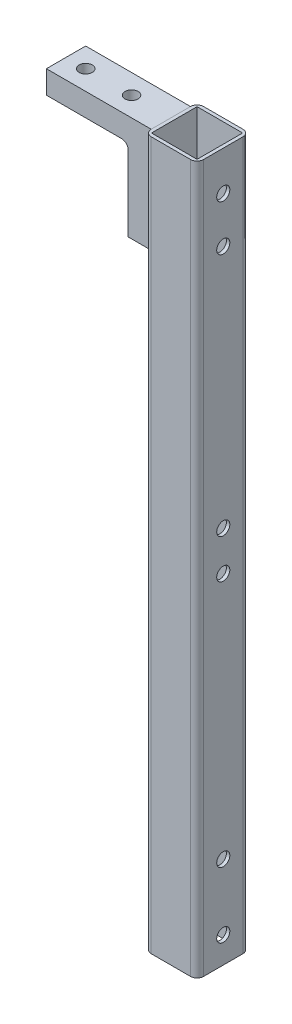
ISO-10303-21;
HEADER;
FILE_DESCRIPTION(('STEP AP214'),'2;1');
FILE_NAME('part.step','',(''),(''),'','','');
FILE_SCHEMA(('AUTOMOTIVE_DESIGN { 1 0 10303 214 1 1 1 1 }'));
ENDSEC;
DATA;
#1=APPLICATION_CONTEXT('core data for automotive mechanical design processes');
#2=APPLICATION_PROTOCOL_DEFINITION('international standard','automotive_design',2000,#1);
#3=PRODUCT_CONTEXT('',#1,'mechanical');
#4=PRODUCT('Part','Part','',(#3));
#5=PRODUCT_RELATED_PRODUCT_CATEGORY('part','',(#4));
#6=PRODUCT_DEFINITION_FORMATION('','',#4);
#7=PRODUCT_DEFINITION_CONTEXT('part definition',#1,'design');
#8=PRODUCT_DEFINITION('design','',#6,#7);
#9=PRODUCT_DEFINITION_SHAPE('','',#8);
#10=(LENGTH_UNIT() NAMED_UNIT(*) SI_UNIT(.MILLI.,.METRE.));
#11=(NAMED_UNIT(*) PLANE_ANGLE_UNIT() SI_UNIT($,.RADIAN.));
#12=(NAMED_UNIT(*) SI_UNIT($,.STERADIAN.) SOLID_ANGLE_UNIT());
#13=UNCERTAINTY_MEASURE_WITH_UNIT(LENGTH_MEASURE(1.E-05),#10,'distance_accuracy_value','');
#14=(GEOMETRIC_REPRESENTATION_CONTEXT(3) GLOBAL_UNCERTAINTY_ASSIGNED_CONTEXT((#13)) GLOBAL_UNIT_ASSIGNED_CONTEXT((#10,
#11,#12)) REPRESENTATION_CONTEXT('',''));
#15=CARTESIAN_POINT('',(0.,0.,0.));
#16=DIRECTION('',(0.,0.,1.));
#17=DIRECTION('',(1.,0.,0.));
#18=AXIS2_PLACEMENT_3D('',#15,#16,#17);
#19=CARTESIAN_POINT('',(0.,0.,9.525));
#20=DIRECTION('',(0.,-1.,0.));
#21=DIRECTION('',(1.,0.,0.));
#22=AXIS2_PLACEMENT_3D('',#19,#20,#21);
#23=PLANE('',#22);
#24=CARTESIAN_POINT('',(-41.275,0.,0.));
#25=DIRECTION('',(0.,-1.,0.));
#26=DIRECTION('',(1.,0.,0.));
#27=AXIS2_PLACEMENT_3D('',#24,#25,#26);
#28=CIRCLE('',#27,3.17499999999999);
#29=CARTESIAN_POINT('',(-38.1,0.,0.));
#30=VERTEX_POINT('',#29);
#31=EDGE_CURVE('E244',#30,#30,#28,.T.);
#32=ORIENTED_EDGE('',*,*,#31,.T.);
#33=EDGE_LOOP('',(#32));
#34=FACE_BOUND('',#33,.T.);
#35=CARTESIAN_POINT('',(-19.05,0.,0.));
#36=DIRECTION('',(0.,-1.,0.));
#37=DIRECTION('',(1.,0.,0.));
#38=AXIS2_PLACEMENT_3D('',#35,#36,#37);
#39=CIRCLE('',#38,3.17499999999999);
#40=CARTESIAN_POINT('',(-15.875,0.,0.));
#41=VERTEX_POINT('',#40);
#42=EDGE_CURVE('E248',#41,#41,#39,.T.);
#43=ORIENTED_EDGE('',*,*,#42,.T.);
#44=EDGE_LOOP('',(#43));
#45=FACE_BOUND('',#44,.T.);
#46=DIRECTION('',(-1.,0.,0.));
#47=VECTOR('',#46,1.);
#48=CARTESIAN_POINT('',(0.,0.,-9.525));
#49=LINE('',#48,#47);
#50=CARTESIAN_POINT('',(0.,0.,-9.525));
#51=VERTEX_POINT('',#50);
#52=CARTESIAN_POINT('',(-50.8,0.,-9.525));
#53=VERTEX_POINT('',#52);
#54=EDGE_CURVE('E125',#51,#53,#49,.T.);
#55=ORIENTED_EDGE('',*,*,#54,.T.);
#56=DIRECTION('',(0.,0.,-1.));
#57=VECTOR('',#56,1.);
#58=CARTESIAN_POINT('',(-50.8,0.,9.525));
#59=LINE('',#58,#57);
#60=CARTESIAN_POINT('',(-50.8,0.,9.525));
#61=VERTEX_POINT('',#60);
#62=EDGE_CURVE('E107',#61,#53,#59,.T.);
#63=ORIENTED_EDGE('',*,*,#62,.F.);
#64=DIRECTION('',(-1.,0.,0.));
#65=VECTOR('',#64,1.);
#66=CARTESIAN_POINT('',(0.,0.,9.525));
#67=LINE('',#66,#65);
#68=CARTESIAN_POINT('',(0.,0.,9.525));
#69=VERTEX_POINT('',#68);
#70=EDGE_CURVE('E113',#69,#61,#67,.T.);
#71=ORIENTED_EDGE('',*,*,#70,.F.);
#72=DIRECTION('',(0.,0.,-1.));
#73=VECTOR('',#72,1.);
#74=CARTESIAN_POINT('',(0.,0.,9.525));
#75=LINE('',#74,#73);
#76=EDGE_CURVE('E156',#69,#51,#75,.T.);
#77=ORIENTED_EDGE('',*,*,#76,.T.);
#78=EDGE_LOOP('',(#55,#63,#71,#77));
#79=FACE_BOUND('',#78,.T.);
#80=ADVANCED_FACE('F42',(#34,#45,#79),#23,.F.);
#81=CARTESIAN_POINT('',(-50.8,0.,9.525));
#82=DIRECTION('',(1.,0.,0.));
#83=DIRECTION('',(0.,0.,-1.));
#84=AXIS2_PLACEMENT_3D('',#81,#82,#83);
#85=PLANE('',#84);
#86=DIRECTION('',(0.,-1.,0.));
#87=VECTOR('',#86,1.);
#88=CARTESIAN_POINT('',(-50.8,0.,-9.525));
#89=LINE('',#88,#87);
#90=CARTESIAN_POINT('',(-50.8,-11.1252,-9.525));
#91=VERTEX_POINT('',#90);
#92=EDGE_CURVE('E140',#53,#91,#89,.T.);
#93=ORIENTED_EDGE('',*,*,#92,.T.);
#94=DIRECTION('',(0.,0.,-1.));
#95=VECTOR('',#94,1.);
#96=CARTESIAN_POINT('',(-50.8,-11.1252,9.525));
#97=LINE('',#96,#95);
#98=CARTESIAN_POINT('',(-50.8,-11.1252,9.525));
#99=VERTEX_POINT('',#98);
#100=EDGE_CURVE('E110',#99,#91,#97,.T.);
#101=ORIENTED_EDGE('',*,*,#100,.F.);
#102=DIRECTION('',(0.,-1.,0.));
#103=VECTOR('',#102,1.);
#104=CARTESIAN_POINT('',(-50.8,0.,9.525));
#105=LINE('',#104,#103);
#106=EDGE_CURVE('E103',#61,#99,#105,.T.);
#107=ORIENTED_EDGE('',*,*,#106,.F.);
#108=ORIENTED_EDGE('',*,*,#62,.T.);
#109=EDGE_LOOP('',(#93,#101,#107,#108));
#110=FACE_BOUND('',#109,.T.);
#111=ADVANCED_FACE('F105',(#110),#85,.F.);
#112=CARTESIAN_POINT('',(-50.8,-11.1252,9.525));
#113=DIRECTION('',(0.,1.,0.));
#114=DIRECTION('',(0.,0.,1.));
#115=AXIS2_PLACEMENT_3D('',#112,#113,#114);
#116=PLANE('',#115);
#117=CARTESIAN_POINT('',(-41.275,-11.1252,0.));
#118=DIRECTION('',(0.,-1.,0.));
#119=DIRECTION('',(0.,0.,-1.));
#120=AXIS2_PLACEMENT_3D('',#117,#118,#119);
#121=CIRCLE('',#120,3.17499999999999);
#122=CARTESIAN_POINT('',(-41.275,-11.1252,-3.17499999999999));
#123=VERTEX_POINT('',#122);
#124=EDGE_CURVE('E242',#123,#123,#121,.T.);
#125=ORIENTED_EDGE('',*,*,#124,.F.);
#126=EDGE_LOOP('',(#125));
#127=FACE_BOUND('',#126,.T.);
#128=CARTESIAN_POINT('',(-19.05,-11.1252,0.));
#129=DIRECTION('',(0.,-1.,0.));
#130=DIRECTION('',(0.,0.,-1.));
#131=AXIS2_PLACEMENT_3D('',#128,#129,#130);
#132=CIRCLE('',#131,3.17499999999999);
#133=CARTESIAN_POINT('',(-19.05,-11.1252,-3.17499999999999));
#134=VERTEX_POINT('',#133);
#135=EDGE_CURVE('E245',#134,#134,#132,.T.);
#136=ORIENTED_EDGE('',*,*,#135,.F.);
#137=EDGE_LOOP('',(#136));
#138=FACE_BOUND('',#137,.T.);
#139=DIRECTION('',(1.,0.,0.));
#140=VECTOR('',#139,1.);
#141=CARTESIAN_POINT('',(-50.8,-11.1252,-9.525));
#142=LINE('',#141,#140);
#143=CARTESIAN_POINT('',(-14.3002,-11.1252,-9.525));
#144=VERTEX_POINT('',#143);
#145=EDGE_CURVE('E159',#91,#144,#142,.T.);
#146=ORIENTED_EDGE('',*,*,#145,.T.);
#147=DIRECTION('',(0.,0.,-1.));
#148=VECTOR('',#147,1.);
#149=CARTESIAN_POINT('',(-14.3002,-11.1252,9.525));
#150=LINE('',#149,#148);
#151=CARTESIAN_POINT('',(-14.3002,-11.1252,9.525));
#152=VERTEX_POINT('',#151);
#153=EDGE_CURVE('E59',#144,#152,#150,.F.);
#154=ORIENTED_EDGE('',*,*,#153,.T.);
#155=DIRECTION('',(1.,0.,0.));
#156=VECTOR('',#155,1.);
#157=CARTESIAN_POINT('',(-50.8,-11.1252,9.525));
#158=LINE('',#157,#156);
#159=EDGE_CURVE('E112',#99,#152,#158,.T.);
#160=ORIENTED_EDGE('',*,*,#159,.F.);
#161=ORIENTED_EDGE('',*,*,#100,.T.);
#162=EDGE_LOOP('',(#146,#154,#160,#161));
#163=FACE_BOUND('',#162,.T.);
#164=ADVANCED_FACE('F198',(#127,#138,#163),#116,.F.);
#165=CARTESIAN_POINT('',(-11.1252,-11.1252,9.525));
#166=DIRECTION('',(1.,0.,0.));
#167=DIRECTION('',(0.,1.,0.));
#168=AXIS2_PLACEMENT_3D('',#165,#166,#167);
#169=PLANE('',#168);
#170=CARTESIAN_POINT('',(-11.1252,-19.05,0.));
#171=DIRECTION('',(-1.,0.,0.));
#172=DIRECTION('',(0.,0.,1.));
#173=AXIS2_PLACEMENT_3D('',#170,#171,#172);
#174=CIRCLE('',#173,3.17499999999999);
#175=CARTESIAN_POINT('',(-11.1252,-19.05,3.17499999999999));
#176=VERTEX_POINT('',#175);
#177=EDGE_CURVE('E147',#176,#176,#174,.T.);
#178=ORIENTED_EDGE('',*,*,#177,.F.);
#179=EDGE_LOOP('',(#178));
#180=FACE_BOUND('',#179,.T.);
#181=CARTESIAN_POINT('',(-11.1252,-41.275,0.));
#182=DIRECTION('',(-1.,0.,0.));
#183=DIRECTION('',(0.,0.,1.));
#184=AXIS2_PLACEMENT_3D('',#181,#182,#183);
#185=CIRCLE('',#184,3.17499999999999);
#186=CARTESIAN_POINT('',(-11.1252,-41.275,3.17499999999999));
#187=VERTEX_POINT('',#186);
#188=EDGE_CURVE('E137',#187,#187,#185,.T.);
#189=ORIENTED_EDGE('',*,*,#188,.F.);
#190=EDGE_LOOP('',(#189));
#191=FACE_BOUND('',#190,.T.);
#192=DIRECTION('',(0.,-1.,0.));
#193=VECTOR('',#192,1.);
#194=CARTESIAN_POINT('',(-11.1252,-11.1252,9.525));
#195=LINE('',#194,#193);
#196=CARTESIAN_POINT('',(-11.1252,-14.3002,9.525));
#197=VERTEX_POINT('',#196);
#198=CARTESIAN_POINT('',(-11.1252,-50.8,9.525));
#199=VERTEX_POINT('',#198);
#200=EDGE_CURVE('E152',#197,#199,#195,.T.);
#201=ORIENTED_EDGE('',*,*,#200,.F.);
#202=DIRECTION('',(0.,0.,-1.));
#203=VECTOR('',#202,1.);
#204=CARTESIAN_POINT('',(-11.1252,-14.3002,-9.525));
#205=LINE('',#204,#203);
#206=CARTESIAN_POINT('',(-11.1252,-14.3002,-9.525));
#207=VERTEX_POINT('',#206);
#208=EDGE_CURVE('E126',#197,#207,#205,.T.);
#209=ORIENTED_EDGE('',*,*,#208,.T.);
#210=DIRECTION('',(0.,-1.,0.));
#211=VECTOR('',#210,1.);
#212=CARTESIAN_POINT('',(-11.1252,-11.1252,-9.525));
#213=LINE('',#212,#211);
#214=CARTESIAN_POINT('',(-11.1252,-50.8,-9.525));
#215=VERTEX_POINT('',#214);
#216=EDGE_CURVE('E161',#207,#215,#213,.T.);
#217=ORIENTED_EDGE('',*,*,#216,.T.);
#218=DIRECTION('',(0.,0.,-1.));
#219=VECTOR('',#218,1.);
#220=CARTESIAN_POINT('',(-11.1252,-50.8,9.525));
#221=LINE('',#220,#219);
#222=EDGE_CURVE('E130',#199,#215,#221,.T.);
#223=ORIENTED_EDGE('',*,*,#222,.F.);
#224=EDGE_LOOP('',(#201,#209,#217,#223));
#225=FACE_BOUND('',#224,.T.);
#226=ADVANCED_FACE('F190',(#180,#191,#225),#169,.F.);
#227=CARTESIAN_POINT('',(-11.1252,-50.8,9.525));
#228=DIRECTION('',(0.,1.,0.));
#229=DIRECTION('',(-1.,0.,0.));
#230=AXIS2_PLACEMENT_3D('',#227,#228,#229);
#231=PLANE('',#230);
#232=DIRECTION('',(1.,0.,0.));
#233=VECTOR('',#232,1.);
#234=CARTESIAN_POINT('',(-11.1252,-50.8,-9.525));
#235=LINE('',#234,#233);
#236=CARTESIAN_POINT('',(0.,-50.8,-9.525));
#237=VERTEX_POINT('',#236);
#238=EDGE_CURVE('E163',#215,#237,#235,.T.);
#239=ORIENTED_EDGE('',*,*,#238,.T.);
#240=DIRECTION('',(0.,0.,-1.));
#241=VECTOR('',#240,1.);
#242=CARTESIAN_POINT('',(0.,-50.8,9.525));
#243=LINE('',#242,#241);
#244=CARTESIAN_POINT('',(0.,-50.8,9.525));
#245=VERTEX_POINT('',#244);
#246=EDGE_CURVE('E167',#245,#237,#243,.T.);
#247=ORIENTED_EDGE('',*,*,#246,.F.);
#248=DIRECTION('',(1.,0.,0.));
#249=VECTOR('',#248,1.);
#250=CARTESIAN_POINT('',(-11.1252,-50.8,9.525));
#251=LINE('',#250,#249);
#252=EDGE_CURVE('E154',#199,#245,#251,.T.);
#253=ORIENTED_EDGE('',*,*,#252,.F.);
#254=ORIENTED_EDGE('',*,*,#222,.T.);
#255=EDGE_LOOP('',(#239,#247,#253,#254));
#256=FACE_BOUND('',#255,.T.);
#257=ADVANCED_FACE('F174',(#256),#231,.F.);
#258=CARTESIAN_POINT('',(0.,-50.8,9.525));
#259=DIRECTION('',(-1.,0.,0.));
#260=DIRECTION('',(0.,0.,1.));
#261=AXIS2_PLACEMENT_3D('',#258,#259,#260);
#262=PLANE('',#261);
#263=CARTESIAN_POINT('',(0.,-19.05,0.));
#264=DIRECTION('',(-1.,0.,0.));
#265=DIRECTION('',(0.,0.,1.));
#266=AXIS2_PLACEMENT_3D('',#263,#264,#265);
#267=CIRCLE('',#266,3.17499999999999);
#268=CARTESIAN_POINT('',(0.,-19.05,3.17499999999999));
#269=VERTEX_POINT('',#268);
#270=EDGE_CURVE('E46',#269,#269,#267,.T.);
#271=ORIENTED_EDGE('',*,*,#270,.T.);
#272=EDGE_LOOP('',(#271));
#273=FACE_BOUND('',#272,.T.);
#274=CARTESIAN_POINT('',(0.,-41.275,0.));
#275=DIRECTION('',(-1.,0.,0.));
#276=DIRECTION('',(0.,0.,1.));
#277=AXIS2_PLACEMENT_3D('',#274,#275,#276);
#278=CIRCLE('',#277,3.17499999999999);
#279=CARTESIAN_POINT('',(0.,-41.275,3.17499999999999));
#280=VERTEX_POINT('',#279);
#281=EDGE_CURVE('E135',#280,#280,#278,.T.);
#282=ORIENTED_EDGE('',*,*,#281,.T.);
#283=EDGE_LOOP('',(#282));
#284=FACE_BOUND('',#283,.T.);
#285=DIRECTION('',(0.,1.,0.));
#286=VECTOR('',#285,1.);
#287=CARTESIAN_POINT('',(0.,-50.8,-9.525));
#288=LINE('',#287,#286);
#289=EDGE_CURVE('E122',#237,#51,#288,.T.);
#290=ORIENTED_EDGE('',*,*,#289,.T.);
#291=ORIENTED_EDGE('',*,*,#76,.F.);
#292=DIRECTION('',(0.,1.,0.));
#293=VECTOR('',#292,1.);
#294=CARTESIAN_POINT('',(0.,-50.8,9.525));
#295=LINE('',#294,#293);
#296=EDGE_CURVE('E118',#245,#69,#295,.T.);
#297=ORIENTED_EDGE('',*,*,#296,.F.);
#298=ORIENTED_EDGE('',*,*,#246,.T.);
#299=EDGE_LOOP('',(#290,#291,#297,#298));
#300=FACE_BOUND('',#299,.T.);
#301=ADVANCED_FACE('F181',(#273,#284,#300),#262,.F.);
#302=CARTESIAN_POINT('',(0.,0.,9.525));
#303=DIRECTION('',(0.,0.,1.));
#304=DIRECTION('',(1.,0.,0.));
#305=AXIS2_PLACEMENT_3D('',#302,#303,#304);
#306=PLANE('',#305);
#307=ORIENTED_EDGE('',*,*,#70,.T.);
#308=ORIENTED_EDGE('',*,*,#106,.T.);
#309=ORIENTED_EDGE('',*,*,#159,.T.);
#310=CARTESIAN_POINT('',(-14.3002,-14.3002,9.525));
#311=DIRECTION('',(0.,0.,1.));
#312=DIRECTION('',(1.,0.,0.));
#313=AXIS2_PLACEMENT_3D('',#310,#311,#312);
#314=CIRCLE('',#313,3.175);
#315=EDGE_CURVE('E12',#152,#197,#314,.F.);
#316=ORIENTED_EDGE('',*,*,#315,.T.);
#317=ORIENTED_EDGE('',*,*,#200,.T.);
#318=ORIENTED_EDGE('',*,*,#252,.T.);
#319=ORIENTED_EDGE('',*,*,#296,.T.);
#320=EDGE_LOOP('',(#307,#308,#309,#316,#317,#318,#319));
#321=FACE_BOUND('',#320,.T.);
#322=ADVANCED_FACE('F116',(#321),#306,.T.);
#323=CARTESIAN_POINT('',(0.,0.,-9.525));
#324=DIRECTION('',(0.,0.,1.));
#325=DIRECTION('',(1.,0.,0.));
#326=AXIS2_PLACEMENT_3D('',#323,#324,#325);
#327=PLANE('',#326);
#328=ORIENTED_EDGE('',*,*,#54,.F.);
#329=ORIENTED_EDGE('',*,*,#289,.F.);
#330=ORIENTED_EDGE('',*,*,#238,.F.);
#331=ORIENTED_EDGE('',*,*,#216,.F.);
#332=CARTESIAN_POINT('',(-14.3002,-14.3002,-9.525));
#333=DIRECTION('',(0.,0.,1.));
#334=DIRECTION('',(1.,0.,0.));
#335=AXIS2_PLACEMENT_3D('',#332,#333,#334);
#336=CIRCLE('',#335,3.175);
#337=EDGE_CURVE('E51',#207,#144,#336,.T.);
#338=ORIENTED_EDGE('',*,*,#337,.T.);
#339=ORIENTED_EDGE('',*,*,#145,.F.);
#340=ORIENTED_EDGE('',*,*,#92,.F.);
#341=EDGE_LOOP('',(#328,#329,#330,#331,#338,#339,#340));
#342=FACE_BOUND('',#341,.T.);
#343=ADVANCED_FACE('F179',(#342),#327,.F.);
#344=CARTESIAN_POINT('',(-14.3002,-14.3002,9.525));
#345=DIRECTION('',(0.,0.,1.));
#346=DIRECTION('',(1.,0.,0.));
#347=AXIS2_PLACEMENT_3D('',#344,#345,#346);
#348=CYLINDRICAL_SURFACE('',#347,3.175);
#349=ORIENTED_EDGE('',*,*,#315,.F.);
#350=ORIENTED_EDGE('',*,*,#153,.F.);
#351=ORIENTED_EDGE('',*,*,#337,.F.);
#352=ORIENTED_EDGE('',*,*,#208,.F.);
#353=EDGE_LOOP('',(#349,#350,#351,#352));
#354=FACE_BOUND('',#353,.T.);
#355=ADVANCED_FACE('F44',(#354),#348,.F.);
#356=CARTESIAN_POINT('',(-11.1252,-41.275,0.));
#357=DIRECTION('',(-1.,0.,0.));
#358=DIRECTION('',(0.,0.,1.));
#359=AXIS2_PLACEMENT_3D('',#356,#357,#358);
#360=CYLINDRICAL_SURFACE('',#359,3.17499999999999);
#361=ORIENTED_EDGE('',*,*,#188,.T.);
#362=EDGE_LOOP('',(#361));
#363=FACE_BOUND('',#362,.T.);
#364=ORIENTED_EDGE('',*,*,#281,.F.);
#365=EDGE_LOOP('',(#364));
#366=FACE_BOUND('',#365,.T.);
#367=ADVANCED_FACE('F217',(#363,#366),#360,.F.);
#368=CARTESIAN_POINT('',(-11.1252,-19.05,0.));
#369=DIRECTION('',(-1.,0.,0.));
#370=DIRECTION('',(0.,0.,1.));
#371=AXIS2_PLACEMENT_3D('',#368,#369,#370);
#372=CYLINDRICAL_SURFACE('',#371,3.17499999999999);
#373=ORIENTED_EDGE('',*,*,#177,.T.);
#374=EDGE_LOOP('',(#373));
#375=FACE_BOUND('',#374,.T.);
#376=ORIENTED_EDGE('',*,*,#270,.F.);
#377=EDGE_LOOP('',(#376));
#378=FACE_BOUND('',#377,.T.);
#379=ADVANCED_FACE('F222',(#375,#378),#372,.F.);
#380=CARTESIAN_POINT('',(-19.05,-11.1252,0.));
#381=DIRECTION('',(0.,-1.,0.));
#382=DIRECTION('',(0.,0.,-1.));
#383=AXIS2_PLACEMENT_3D('',#380,#381,#382);
#384=CYLINDRICAL_SURFACE('',#383,3.17499999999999);
#385=ORIENTED_EDGE('',*,*,#135,.T.);
#386=EDGE_LOOP('',(#385));
#387=FACE_BOUND('',#386,.T.);
#388=ORIENTED_EDGE('',*,*,#42,.F.);
#389=EDGE_LOOP('',(#388));
#390=FACE_BOUND('',#389,.T.);
#391=ADVANCED_FACE('F229',(#387,#390),#384,.F.);
#392=CARTESIAN_POINT('',(-41.275,-11.1252,0.));
#393=DIRECTION('',(0.,-1.,0.));
#394=DIRECTION('',(0.,0.,-1.));
#395=AXIS2_PLACEMENT_3D('',#392,#393,#394);
#396=CYLINDRICAL_SURFACE('',#395,3.17499999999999);
#397=ORIENTED_EDGE('',*,*,#124,.T.);
#398=EDGE_LOOP('',(#397));
#399=FACE_BOUND('',#398,.T.);
#400=ORIENTED_EDGE('',*,*,#31,.F.);
#401=EDGE_LOOP('',(#400));
#402=FACE_BOUND('',#401,.T.);
#403=ADVANCED_FACE('F233',(#399,#402),#396,.F.);
#404=CLOSED_SHELL('',(#80,#111,#164,#226,#257,#301,#322,#343,#355,#367,#379,#391,#403));
#405=MANIFOLD_SOLID_BREP('B2',#404);
#406=CARTESIAN_POINT('',(0.,-342.9,12.7));
#407=DIRECTION('',(1.,0.,0.));
#408=DIRECTION('',(0.,0.,-1.));
#409=AXIS2_PLACEMENT_3D('',#406,#407,#408);
#410=PLANE('',#409);
#411=CARTESIAN_POINT('',(0.,-298.45,0.));
#412=DIRECTION('',(1.,0.,0.));
#413=DIRECTION('',(0.,0.,-1.));
#414=AXIS2_PLACEMENT_3D('',#411,#412,#413);
#415=CIRCLE('',#414,3.175);
#416=CARTESIAN_POINT('',(0.,-298.45,-3.175));
#417=VERTEX_POINT('',#416);
#418=EDGE_CURVE('E542',#417,#417,#415,.T.);
#419=ORIENTED_EDGE('',*,*,#418,.T.);
#420=EDGE_LOOP('',(#419));
#421=FACE_BOUND('',#420,.T.);
#422=CARTESIAN_POINT('',(0.,-159.5374,0.));
#423=DIRECTION('',(1.,0.,0.));
#424=DIRECTION('',(0.,0.,-1.));
#425=AXIS2_PLACEMENT_3D('',#422,#423,#424);
#426=CIRCLE('',#425,3.175);
#427=CARTESIAN_POINT('',(0.,-159.5374,3.175));
#428=VERTEX_POINT('',#427);
#429=EDGE_CURVE('E534',#428,#428,#426,.T.);
#430=ORIENTED_EDGE('',*,*,#429,.T.);
#431=EDGE_LOOP('',(#430));
#432=FACE_BOUND('',#431,.T.);
#433=CARTESIAN_POINT('',(0.,-19.05,0.));
#434=DIRECTION('',(1.,0.,0.));
#435=DIRECTION('',(0.,0.,-1.));
#436=AXIS2_PLACEMENT_3D('',#433,#434,#435);
#437=CIRCLE('',#436,3.17499999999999);
#438=CARTESIAN_POINT('',(0.,-19.05,-3.17499999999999));
#439=VERTEX_POINT('',#438);
#440=EDGE_CURVE('E517',#439,#439,#437,.T.);
#441=ORIENTED_EDGE('',*,*,#440,.T.);
#442=EDGE_LOOP('',(#441));
#443=FACE_BOUND('',#442,.T.);
#444=CARTESIAN_POINT('',(0.,-41.275,0.));
#445=DIRECTION('',(1.,0.,0.));
#446=DIRECTION('',(0.,0.,-1.));
#447=AXIS2_PLACEMENT_3D('',#444,#445,#446);
#448=CIRCLE('',#447,3.17499999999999);
#449=CARTESIAN_POINT('',(0.,-41.275,-3.17499999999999));
#450=VERTEX_POINT('',#449);
#451=EDGE_CURVE('E514',#450,#450,#448,.T.);
#452=ORIENTED_EDGE('',*,*,#451,.T.);
#453=EDGE_LOOP('',(#452));
#454=FACE_BOUND('',#453,.T.);
#455=DIRECTION('',(0.,0.,-1.));
#456=VECTOR('',#455,1.);
#457=CARTESIAN_POINT('',(0.,0.,12.7));
#458=LINE('',#457,#456);
#459=CARTESIAN_POINT('',(0.,0.,9.525));
#460=VERTEX_POINT('',#459);
#461=CARTESIAN_POINT('',(0.,0.,-9.525));
#462=VERTEX_POINT('',#461);
#463=EDGE_CURVE('E470',#460,#462,#458,.T.);
#464=ORIENTED_EDGE('',*,*,#463,.T.);
#465=DIRECTION('',(0.,-1.,0.));
#466=VECTOR('',#465,1.);
#467=CARTESIAN_POINT('',(0.,-342.9,-9.525));
#468=LINE('',#467,#466);
#469=CARTESIAN_POINT('',(0.,-342.9,-9.525));
#470=VERTEX_POINT('',#469);
#471=EDGE_CURVE('E510',#462,#470,#468,.T.);
#472=ORIENTED_EDGE('',*,*,#471,.T.);
#473=DIRECTION('',(0.,0.,-1.));
#474=VECTOR('',#473,1.);
#475=CARTESIAN_POINT('',(0.,-342.9,12.7));
#476=LINE('',#475,#474);
#477=CARTESIAN_POINT('',(0.,-342.9,9.525));
#478=VERTEX_POINT('',#477);
#479=EDGE_CURVE('E483',#478,#470,#476,.T.);
#480=ORIENTED_EDGE('',*,*,#479,.F.);
#481=DIRECTION('',(0.,-1.,0.));
#482=VECTOR('',#481,1.);
#483=CARTESIAN_POINT('',(0.,-342.9,9.525));
#484=LINE('',#483,#482);
#485=EDGE_CURVE('E508',#478,#460,#484,.F.);
#486=ORIENTED_EDGE('',*,*,#485,.T.);
#487=EDGE_LOOP('',(#464,#472,#480,#486));
#488=FACE_BOUND('',#487,.T.);
#489=CARTESIAN_POINT('',(0.,-178.5874,0.));
#490=DIRECTION('',(1.,0.,0.));
#491=DIRECTION('',(0.,0.,-1.));
#492=AXIS2_PLACEMENT_3D('',#489,#490,#491);
#493=CIRCLE('',#492,3.175);
#494=CARTESIAN_POINT('',(0.,-178.5874,3.175));
#495=VERTEX_POINT('',#494);
#496=EDGE_CURVE('E538',#495,#495,#493,.T.);
#497=ORIENTED_EDGE('',*,*,#496,.T.);
#498=EDGE_LOOP('',(#497));
#499=FACE_BOUND('',#498,.T.);
#500=CARTESIAN_POINT('',(0.,-330.2,0.));
#501=DIRECTION('',(1.,0.,0.));
#502=DIRECTION('',(0.,0.,-1.));
#503=AXIS2_PLACEMENT_3D('',#500,#501,#502);
#504=CIRCLE('',#503,3.175);
#505=CARTESIAN_POINT('',(0.,-330.2,-3.175));
#506=VERTEX_POINT('',#505);
#507=EDGE_CURVE('E712',#506,#506,#504,.T.);
#508=ORIENTED_EDGE('',*,*,#507,.T.);
#509=EDGE_LOOP('',(#508));
#510=FACE_BOUND('',#509,.T.);
#511=ADVANCED_FACE('F328',(#421,#432,#443,#454,#488,#499,#510),#410,.F.);
#512=CARTESIAN_POINT('',(25.4,0.,12.7));
#513=DIRECTION('',(-1.,0.,0.));
#514=DIRECTION('',(0.,-1.,0.));
#515=AXIS2_PLACEMENT_3D('',#512,#513,#514);
#516=PLANE('',#515);
#517=CARTESIAN_POINT('',(25.4,-298.45,0.));
#518=DIRECTION('',(-1.,0.,0.));
#519=DIRECTION('',(0.,-1.,0.));
#520=AXIS2_PLACEMENT_3D('',#517,#518,#519);
#521=CIRCLE('',#520,3.175);
#522=CARTESIAN_POINT('',(25.4,-301.625,0.));
#523=VERTEX_POINT('',#522);
#524=EDGE_CURVE('E546',#523,#523,#521,.F.);
#525=ORIENTED_EDGE('',*,*,#524,.F.);
#526=EDGE_LOOP('',(#525));
#527=FACE_BOUND('',#526,.T.);
#528=CARTESIAN_POINT('',(25.4,-159.5374,0.));
#529=DIRECTION('',(-1.,0.,0.));
#530=DIRECTION('',(0.,-1.,0.));
#531=AXIS2_PLACEMENT_3D('',#528,#529,#530);
#532=CIRCLE('',#531,3.175);
#533=CARTESIAN_POINT('',(25.4,-159.5374,3.175));
#534=VERTEX_POINT('',#533);
#535=EDGE_CURVE('E526',#534,#534,#532,.F.);
#536=ORIENTED_EDGE('',*,*,#535,.F.);
#537=EDGE_LOOP('',(#536));
#538=FACE_BOUND('',#537,.T.);
#539=CARTESIAN_POINT('',(25.4,-41.275,0.));
#540=DIRECTION('',(-1.,0.,0.));
#541=DIRECTION('',(0.,-1.,0.));
#542=AXIS2_PLACEMENT_3D('',#539,#540,#541);
#543=CIRCLE('',#542,3.17499999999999);
#544=CARTESIAN_POINT('',(25.4,-44.45,0.));
#545=VERTEX_POINT('',#544);
#546=EDGE_CURVE('E521',#545,#545,#543,.T.);
#547=ORIENTED_EDGE('',*,*,#546,.T.);
#548=EDGE_LOOP('',(#547));
#549=FACE_BOUND('',#548,.T.);
#550=CARTESIAN_POINT('',(25.4,-19.05,0.));
#551=DIRECTION('',(-1.,0.,0.));
#552=DIRECTION('',(0.,-1.,0.));
#553=AXIS2_PLACEMENT_3D('',#550,#551,#552);
#554=CIRCLE('',#553,3.17499999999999);
#555=CARTESIAN_POINT('',(25.4,-22.225,0.));
#556=VERTEX_POINT('',#555);
#557=EDGE_CURVE('E525',#556,#556,#554,.T.);
#558=ORIENTED_EDGE('',*,*,#557,.T.);
#559=EDGE_LOOP('',(#558));
#560=FACE_BOUND('',#559,.T.);
#561=DIRECTION('',(0.,0.,-1.));
#562=VECTOR('',#561,1.);
#563=CARTESIAN_POINT('',(25.4,-342.9,12.7));
#564=LINE('',#563,#562);
#565=CARTESIAN_POINT('',(25.4,-342.9,9.525));
#566=VERTEX_POINT('',#565);
#567=CARTESIAN_POINT('',(25.4,-342.9,-9.525));
#568=VERTEX_POINT('',#567);
#569=EDGE_CURVE('E480',#566,#568,#564,.T.);
#570=ORIENTED_EDGE('',*,*,#569,.T.);
#571=DIRECTION('',(0.,1.,0.));
#572=VECTOR('',#571,1.);
#573=CARTESIAN_POINT('',(25.4,0.,-9.525));
#574=LINE('',#573,#572);
#575=CARTESIAN_POINT('',(25.4,0.,-9.525));
#576=VERTEX_POINT('',#575);
#577=EDGE_CURVE('E487',#568,#576,#574,.T.);
#578=ORIENTED_EDGE('',*,*,#577,.T.);
#579=DIRECTION('',(0.,0.,-1.));
#580=VECTOR('',#579,1.);
#581=CARTESIAN_POINT('',(25.4,0.,12.7));
#582=LINE('',#581,#580);
#583=CARTESIAN_POINT('',(25.4,0.,9.525));
#584=VERTEX_POINT('',#583);
#585=EDGE_CURVE('E477',#584,#576,#582,.T.);
#586=ORIENTED_EDGE('',*,*,#585,.F.);
#587=DIRECTION('',(0.,1.,0.));
#588=VECTOR('',#587,1.);
#589=CARTESIAN_POINT('',(25.4,0.,9.525));
#590=LINE('',#589,#588);
#591=EDGE_CURVE('E485',#584,#566,#590,.F.);
#592=ORIENTED_EDGE('',*,*,#591,.T.);
#593=EDGE_LOOP('',(#570,#578,#586,#592));
#594=FACE_BOUND('',#593,.T.);
#595=CARTESIAN_POINT('',(25.4,-178.5874,0.));
#596=DIRECTION('',(-1.,0.,0.));
#597=DIRECTION('',(0.,-1.,0.));
#598=AXIS2_PLACEMENT_3D('',#595,#596,#597);
#599=CIRCLE('',#598,3.175);
#600=CARTESIAN_POINT('',(25.4,-178.5874,3.175));
#601=VERTEX_POINT('',#600);
#602=EDGE_CURVE('E564',#601,#601,#599,.F.);
#603=ORIENTED_EDGE('',*,*,#602,.F.);
#604=EDGE_LOOP('',(#603));
#605=FACE_BOUND('',#604,.T.);
#606=CARTESIAN_POINT('',(25.4,-330.2,0.));
#607=DIRECTION('',(-1.,0.,0.));
#608=DIRECTION('',(0.,-1.,0.));
#609=AXIS2_PLACEMENT_3D('',#606,#607,#608);
#610=CIRCLE('',#609,3.175);
#611=CARTESIAN_POINT('',(25.4,-333.375,0.));
#612=VERTEX_POINT('',#611);
#613=EDGE_CURVE('E549',#612,#612,#610,.F.);
#614=ORIENTED_EDGE('',*,*,#613,.F.);
#615=EDGE_LOOP('',(#614));
#616=FACE_BOUND('',#615,.T.);
#617=ADVANCED_FACE('F606',(#527,#538,#549,#560,#594,#605,#616),#516,.F.);
#618=CARTESIAN_POINT('',(1.651,-342.9,12.7));
#619=DIRECTION('',(1.,0.,0.));
#620=DIRECTION('',(0.,0.,-1.));
#621=AXIS2_PLACEMENT_3D('',#618,#619,#620);
#622=PLANE('',#621);
#623=CARTESIAN_POINT('',(1.651,-298.45,0.));
#624=DIRECTION('',(1.,0.,0.));
#625=DIRECTION('',(0.,0.,-1.));
#626=AXIS2_PLACEMENT_3D('',#623,#624,#625);
#627=CIRCLE('',#626,3.175);
#628=CARTESIAN_POINT('',(1.651,-298.45,-3.175));
#629=VERTEX_POINT('',#628);
#630=EDGE_CURVE('E541',#629,#629,#627,.F.);
#631=ORIENTED_EDGE('',*,*,#630,.T.);
#632=EDGE_LOOP('',(#631));
#633=FACE_BOUND('',#632,.T.);
#634=CARTESIAN_POINT('',(1.651,-159.5374,0.));
#635=DIRECTION('',(1.,0.,0.));
#636=DIRECTION('',(0.,0.,-1.));
#637=AXIS2_PLACEMENT_3D('',#634,#635,#636);
#638=CIRCLE('',#637,3.175);
#639=CARTESIAN_POINT('',(1.651,-159.5374,3.175));
#640=VERTEX_POINT('',#639);
#641=EDGE_CURVE('E533',#640,#640,#638,.F.);
#642=ORIENTED_EDGE('',*,*,#641,.T.);
#643=EDGE_LOOP('',(#642));
#644=FACE_BOUND('',#643,.T.);
#645=CARTESIAN_POINT('',(1.651,-19.05,0.));
#646=DIRECTION('',(1.,0.,0.));
#647=DIRECTION('',(0.,0.,-1.));
#648=AXIS2_PLACEMENT_3D('',#645,#646,#647);
#649=CIRCLE('',#648,3.17499999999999);
#650=CARTESIAN_POINT('',(1.651,-19.05,-3.17499999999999));
#651=VERTEX_POINT('',#650);
#652=EDGE_CURVE('E518',#651,#651,#649,.T.);
#653=ORIENTED_EDGE('',*,*,#652,.F.);
#654=EDGE_LOOP('',(#653));
#655=FACE_BOUND('',#654,.T.);
#656=CARTESIAN_POINT('',(1.651,-41.275,0.));
#657=DIRECTION('',(1.,0.,0.));
#658=DIRECTION('',(0.,0.,-1.));
#659=AXIS2_PLACEMENT_3D('',#656,#657,#658);
#660=CIRCLE('',#659,3.17499999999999);
#661=CARTESIAN_POINT('',(1.651,-41.275,-3.17499999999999));
#662=VERTEX_POINT('',#661);
#663=EDGE_CURVE('E442',#662,#662,#660,.T.);
#664=ORIENTED_EDGE('',*,*,#663,.F.);
#665=EDGE_LOOP('',(#664));
#666=FACE_BOUND('',#665,.T.);
#667=DIRECTION('',(0.,-1.,0.));
#668=VECTOR('',#667,1.);
#669=CARTESIAN_POINT('',(1.651,0.,-11.049));
#670=LINE('',#669,#668);
#671=CARTESIAN_POINT('',(1.651,0.,-11.049));
#672=VERTEX_POINT('',#671);
#673=CARTESIAN_POINT('',(1.651,-342.9,-11.049));
#674=VERTEX_POINT('',#673);
#675=EDGE_CURVE('E425',#672,#674,#670,.T.);
#676=ORIENTED_EDGE('',*,*,#675,.F.);
#677=DIRECTION('',(0.,0.,-1.));
#678=VECTOR('',#677,1.);
#679=CARTESIAN_POINT('',(1.651,0.,12.7));
#680=LINE('',#679,#678);
#681=CARTESIAN_POINT('',(1.651,0.,11.049));
#682=VERTEX_POINT('',#681);
#683=EDGE_CURVE('E455',#682,#672,#680,.T.);
#684=ORIENTED_EDGE('',*,*,#683,.F.);
#685=DIRECTION('',(0.,-1.,0.));
#686=VECTOR('',#685,1.);
#687=CARTESIAN_POINT('',(1.651,0.,11.049));
#688=LINE('',#687,#686);
#689=CARTESIAN_POINT('',(1.651,-342.9,11.049));
#690=VERTEX_POINT('',#689);
#691=EDGE_CURVE('E428',#682,#690,#688,.T.);
#692=ORIENTED_EDGE('',*,*,#691,.T.);
#693=DIRECTION('',(0.,0.,-1.));
#694=VECTOR('',#693,1.);
#695=CARTESIAN_POINT('',(1.651,-342.9,12.7));
#696=LINE('',#695,#694);
#697=EDGE_CURVE('E421',#690,#674,#696,.T.);
#698=ORIENTED_EDGE('',*,*,#697,.T.);
#699=EDGE_LOOP('',(#676,#684,#692,#698));
#700=FACE_BOUND('',#699,.T.);
#701=CARTESIAN_POINT('',(1.651,-178.5874,0.));
#702=DIRECTION('',(1.,0.,0.));
#703=DIRECTION('',(0.,0.,-1.));
#704=AXIS2_PLACEMENT_3D('',#701,#702,#703);
#705=CIRCLE('',#704,3.175);
#706=CARTESIAN_POINT('',(1.651,-178.5874,3.175));
#707=VERTEX_POINT('',#706);
#708=EDGE_CURVE('E537',#707,#707,#705,.F.);
#709=ORIENTED_EDGE('',*,*,#708,.T.);
#710=EDGE_LOOP('',(#709));
#711=FACE_BOUND('',#710,.T.);
#712=CARTESIAN_POINT('',(1.651,-330.2,0.));
#713=DIRECTION('',(1.,0.,0.));
#714=DIRECTION('',(0.,0.,-1.));
#715=AXIS2_PLACEMENT_3D('',#712,#713,#714);
#716=CIRCLE('',#715,3.175);
#717=CARTESIAN_POINT('',(1.651,-330.2,-3.175));
#718=VERTEX_POINT('',#717);
#719=EDGE_CURVE('E554',#718,#718,#716,.F.);
#720=ORIENTED_EDGE('',*,*,#719,.T.);
#721=EDGE_LOOP('',(#720));
#722=FACE_BOUND('',#721,.T.);
#723=ADVANCED_FACE('F423',(#633,#644,#655,#666,#700,#711,#722),#622,.T.);
#724=CARTESIAN_POINT('',(23.749,0.,12.7));
#725=DIRECTION('',(-1.,0.,0.));
#726=DIRECTION('',(0.,-1.,0.));
#727=AXIS2_PLACEMENT_3D('',#724,#725,#726);
#728=PLANE('',#727);
#729=CARTESIAN_POINT('',(23.749,-298.45,0.));
#730=DIRECTION('',(-1.,0.,0.));
#731=DIRECTION('',(0.,-1.,0.));
#732=AXIS2_PLACEMENT_3D('',#729,#730,#731);
#733=CIRCLE('',#732,3.175);
#734=CARTESIAN_POINT('',(23.749,-301.625,0.));
#735=VERTEX_POINT('',#734);
#736=EDGE_CURVE('E539',#735,#735,#733,.F.);
#737=ORIENTED_EDGE('',*,*,#736,.T.);
#738=EDGE_LOOP('',(#737));
#739=FACE_BOUND('',#738,.T.);
#740=CARTESIAN_POINT('',(23.749,-159.5374,0.));
#741=DIRECTION('',(-1.,0.,0.));
#742=DIRECTION('',(0.,-1.,0.));
#743=AXIS2_PLACEMENT_3D('',#740,#741,#742);
#744=CIRCLE('',#743,3.175);
#745=CARTESIAN_POINT('',(23.749,-159.5374,3.175));
#746=VERTEX_POINT('',#745);
#747=EDGE_CURVE('E530',#746,#746,#744,.F.);
#748=ORIENTED_EDGE('',*,*,#747,.T.);
#749=EDGE_LOOP('',(#748));
#750=FACE_BOUND('',#749,.T.);
#751=CARTESIAN_POINT('',(23.749,-41.275,0.));
#752=DIRECTION('',(-1.,0.,0.));
#753=DIRECTION('',(0.,-1.,0.));
#754=AXIS2_PLACEMENT_3D('',#751,#752,#753);
#755=CIRCLE('',#754,3.17499999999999);
#756=CARTESIAN_POINT('',(23.749,-44.45,0.));
#757=VERTEX_POINT('',#756);
#758=EDGE_CURVE('E527',#757,#757,#755,.T.);
#759=ORIENTED_EDGE('',*,*,#758,.F.);
#760=EDGE_LOOP('',(#759));
#761=FACE_BOUND('',#760,.T.);
#762=CARTESIAN_POINT('',(23.749,-19.05,0.));
#763=DIRECTION('',(-1.,0.,0.));
#764=DIRECTION('',(0.,-1.,0.));
#765=AXIS2_PLACEMENT_3D('',#762,#763,#764);
#766=CIRCLE('',#765,3.17499999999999);
#767=CARTESIAN_POINT('',(23.749,-22.225,0.));
#768=VERTEX_POINT('',#767);
#769=EDGE_CURVE('E522',#768,#768,#766,.T.);
#770=ORIENTED_EDGE('',*,*,#769,.F.);
#771=EDGE_LOOP('',(#770));
#772=FACE_BOUND('',#771,.T.);
#773=DIRECTION('',(0.,1.,0.));
#774=VECTOR('',#773,1.);
#775=CARTESIAN_POINT('',(23.749,0.,-11.049));
#776=LINE('',#775,#774);
#777=CARTESIAN_POINT('',(23.749,-342.9,-11.049));
#778=VERTEX_POINT('',#777);
#779=CARTESIAN_POINT('',(23.749,0.,-11.049));
#780=VERTEX_POINT('',#779);
#781=EDGE_CURVE('E446',#778,#780,#776,.T.);
#782=ORIENTED_EDGE('',*,*,#781,.F.);
#783=DIRECTION('',(0.,0.,-1.));
#784=VECTOR('',#783,1.);
#785=CARTESIAN_POINT('',(23.749,-342.9,12.7));
#786=LINE('',#785,#784);
#787=CARTESIAN_POINT('',(23.749,-342.9,11.049));
#788=VERTEX_POINT('',#787);
#789=EDGE_CURVE('E434',#788,#778,#786,.T.);
#790=ORIENTED_EDGE('',*,*,#789,.F.);
#791=DIRECTION('',(0.,1.,0.));
#792=VECTOR('',#791,1.);
#793=CARTESIAN_POINT('',(23.749,0.,11.049));
#794=LINE('',#793,#792);
#795=CARTESIAN_POINT('',(23.749,0.,11.049));
#796=VERTEX_POINT('',#795);
#797=EDGE_CURVE('E454',#788,#796,#794,.T.);
#798=ORIENTED_EDGE('',*,*,#797,.T.);
#799=DIRECTION('',(0.,0.,-1.));
#800=VECTOR('',#799,1.);
#801=CARTESIAN_POINT('',(23.749,0.,12.7));
#802=LINE('',#801,#800);
#803=EDGE_CURVE('E451',#796,#780,#802,.T.);
#804=ORIENTED_EDGE('',*,*,#803,.T.);
#805=EDGE_LOOP('',(#782,#790,#798,#804));
#806=FACE_BOUND('',#805,.T.);
#807=CARTESIAN_POINT('',(23.749,-178.5874,0.));
#808=DIRECTION('',(-1.,0.,0.));
#809=DIRECTION('',(0.,-1.,0.));
#810=AXIS2_PLACEMENT_3D('',#807,#808,#809);
#811=CIRCLE('',#810,3.175);
#812=CARTESIAN_POINT('',(23.749,-178.5874,3.175));
#813=VERTEX_POINT('',#812);
#814=EDGE_CURVE('E535',#813,#813,#811,.F.);
#815=ORIENTED_EDGE('',*,*,#814,.T.);
#816=EDGE_LOOP('',(#815));
#817=FACE_BOUND('',#816,.T.);
#818=CARTESIAN_POINT('',(23.749,-330.2,0.));
#819=DIRECTION('',(-1.,0.,0.));
#820=DIRECTION('',(0.,-1.,0.));
#821=AXIS2_PLACEMENT_3D('',#818,#819,#820);
#822=CIRCLE('',#821,3.175);
#823=CARTESIAN_POINT('',(23.749,-333.375,0.));
#824=VERTEX_POINT('',#823);
#825=EDGE_CURVE('E332',#824,#824,#822,.F.);
#826=ORIENTED_EDGE('',*,*,#825,.T.);
#827=EDGE_LOOP('',(#826));
#828=FACE_BOUND('',#827,.T.);
#829=ADVANCED_FACE('F586',(#739,#750,#761,#772,#806,#817,#828),#728,.T.);
#830=CARTESIAN_POINT('',(25.4,-342.9,12.7));
#831=DIRECTION('',(0.,1.,0.));
#832=DIRECTION('',(0.,0.,1.));
#833=AXIS2_PLACEMENT_3D('',#830,#831,#832);
#834=PLANE('',#833);
#835=DIRECTION('',(1.,0.,0.));
#836=VECTOR('',#835,1.);
#837=CARTESIAN_POINT('',(25.4,-342.9,-12.7));
#838=LINE('',#837,#836);
#839=CARTESIAN_POINT('',(3.175,-342.9,-12.7));
#840=VERTEX_POINT('',#839);
#841=CARTESIAN_POINT('',(22.225,-342.9,-12.7));
#842=VERTEX_POINT('',#841);
#843=EDGE_CURVE('E433',#840,#842,#838,.T.);
#844=ORIENTED_EDGE('',*,*,#843,.T.);
#845=CARTESIAN_POINT('',(22.225,-342.9,-9.525));
#846=DIRECTION('',(0.,1.,0.));
#847=DIRECTION('',(0.,0.,1.));
#848=AXIS2_PLACEMENT_3D('',#845,#846,#847);
#849=CIRCLE('',#848,3.175);
#850=EDGE_CURVE('E506',#842,#568,#849,.F.);
#851=ORIENTED_EDGE('',*,*,#850,.T.);
#852=ORIENTED_EDGE('',*,*,#569,.F.);
#853=CARTESIAN_POINT('',(22.225,-342.9,9.525));
#854=DIRECTION('',(0.,1.,0.));
#855=DIRECTION('',(0.,0.,1.));
#856=AXIS2_PLACEMENT_3D('',#853,#854,#855);
#857=CIRCLE('',#856,3.175);
#858=CARTESIAN_POINT('',(22.225,-342.9,12.7));
#859=VERTEX_POINT('',#858);
#860=EDGE_CURVE('E502',#566,#859,#857,.F.);
#861=ORIENTED_EDGE('',*,*,#860,.T.);
#862=DIRECTION('',(1.,0.,0.));
#863=VECTOR('',#862,1.);
#864=CARTESIAN_POINT('',(25.4,-342.9,12.7));
#865=LINE('',#864,#863);
#866=CARTESIAN_POINT('',(3.175,-342.9,12.7));
#867=VERTEX_POINT('',#866);
#868=EDGE_CURVE('E463',#867,#859,#865,.T.);
#869=ORIENTED_EDGE('',*,*,#868,.F.);
#870=CARTESIAN_POINT('',(3.175,-342.9,9.525));
#871=DIRECTION('',(0.,1.,0.));
#872=DIRECTION('',(0.,0.,1.));
#873=AXIS2_PLACEMENT_3D('',#870,#871,#872);
#874=CIRCLE('',#873,3.175);
#875=EDGE_CURVE('E353',#867,#478,#874,.F.);
#876=ORIENTED_EDGE('',*,*,#875,.T.);
#877=ORIENTED_EDGE('',*,*,#479,.T.);
#878=CARTESIAN_POINT('',(3.175,-342.9,-9.525));
#879=DIRECTION('',(0.,1.,0.));
#880=DIRECTION('',(0.,0.,1.));
#881=AXIS2_PLACEMENT_3D('',#878,#879,#880);
#882=CIRCLE('',#881,3.175);
#883=EDGE_CURVE('E345',#470,#840,#882,.F.);
#884=ORIENTED_EDGE('',*,*,#883,.T.);
#885=EDGE_LOOP('',(#844,#851,#852,#861,#869,#876,#877,#884));
#886=FACE_BOUND('',#885,.T.);
#887=DIRECTION('',(1.,0.,0.));
#888=VECTOR('',#887,1.);
#889=CARTESIAN_POINT('',(0.,-342.9,-11.049));
#890=LINE('',#889,#888);
#891=EDGE_CURVE('E438',#674,#778,#890,.T.);
#892=ORIENTED_EDGE('',*,*,#891,.F.);
#893=ORIENTED_EDGE('',*,*,#697,.F.);
#894=DIRECTION('',(1.,0.,0.));
#895=VECTOR('',#894,1.);
#896=CARTESIAN_POINT('',(0.,-342.9,11.049));
#897=LINE('',#896,#895);
#898=EDGE_CURVE('E452',#690,#788,#897,.T.);
#899=ORIENTED_EDGE('',*,*,#898,.T.);
#900=ORIENTED_EDGE('',*,*,#789,.T.);
#901=EDGE_LOOP('',(#892,#893,#899,#900));
#902=FACE_BOUND('',#901,.T.);
#903=ADVANCED_FACE('F445',(#886,#902),#834,.F.);
#904=CARTESIAN_POINT('',(0.,0.,12.7));
#905=DIRECTION('',(0.,-1.,0.));
#906=DIRECTION('',(0.,0.,-1.));
#907=AXIS2_PLACEMENT_3D('',#904,#905,#906);
#908=PLANE('',#907);
#909=ORIENTED_EDGE('',*,*,#585,.T.);
#910=CARTESIAN_POINT('',(22.225,0.,-9.525));
#911=DIRECTION('',(0.,-1.,0.));
#912=DIRECTION('',(0.,0.,-1.));
#913=AXIS2_PLACEMENT_3D('',#910,#911,#912);
#914=CIRCLE('',#913,3.175);
#915=CARTESIAN_POINT('',(22.225,0.,-12.7));
#916=VERTEX_POINT('',#915);
#917=EDGE_CURVE('E496',#576,#916,#914,.F.);
#918=ORIENTED_EDGE('',*,*,#917,.T.);
#919=DIRECTION('',(-1.,0.,0.));
#920=VECTOR('',#919,1.);
#921=CARTESIAN_POINT('',(0.,0.,-12.7));
#922=LINE('',#921,#920);
#923=CARTESIAN_POINT('',(3.175,0.,-12.7));
#924=VERTEX_POINT('',#923);
#925=EDGE_CURVE('E467',#916,#924,#922,.T.);
#926=ORIENTED_EDGE('',*,*,#925,.T.);
#927=CARTESIAN_POINT('',(3.175,0.,-9.525));
#928=DIRECTION('',(0.,-1.,0.));
#929=DIRECTION('',(0.,0.,-1.));
#930=AXIS2_PLACEMENT_3D('',#927,#928,#929);
#931=CIRCLE('',#930,3.175);
#932=EDGE_CURVE('E494',#924,#462,#931,.F.);
#933=ORIENTED_EDGE('',*,*,#932,.T.);
#934=ORIENTED_EDGE('',*,*,#463,.F.);
#935=CARTESIAN_POINT('',(3.175,0.,9.525));
#936=DIRECTION('',(0.,-1.,0.));
#937=DIRECTION('',(0.,0.,-1.));
#938=AXIS2_PLACEMENT_3D('',#935,#936,#937);
#939=CIRCLE('',#938,3.175);
#940=CARTESIAN_POINT('',(3.175,0.,12.7));
#941=VERTEX_POINT('',#940);
#942=EDGE_CURVE('E492',#460,#941,#939,.F.);
#943=ORIENTED_EDGE('',*,*,#942,.T.);
#944=DIRECTION('',(-1.,0.,0.));
#945=VECTOR('',#944,1.);
#946=CARTESIAN_POINT('',(0.,0.,12.7));
#947=LINE('',#946,#945);
#948=CARTESIAN_POINT('',(22.225,0.,12.7));
#949=VERTEX_POINT('',#948);
#950=EDGE_CURVE('E466',#949,#941,#947,.T.);
#951=ORIENTED_EDGE('',*,*,#950,.F.);
#952=CARTESIAN_POINT('',(22.225,0.,9.525));
#953=DIRECTION('',(0.,-1.,0.));
#954=DIRECTION('',(0.,0.,-1.));
#955=AXIS2_PLACEMENT_3D('',#952,#953,#954);
#956=CIRCLE('',#955,3.175);
#957=EDGE_CURVE('E490',#949,#584,#956,.F.);
#958=ORIENTED_EDGE('',*,*,#957,.T.);
#959=EDGE_LOOP('',(#909,#918,#926,#933,#934,#943,#951,#958));
#960=FACE_BOUND('',#959,.T.);
#961=DIRECTION('',(-1.,0.,0.));
#962=VECTOR('',#961,1.);
#963=CARTESIAN_POINT('',(0.,0.,-11.049));
#964=LINE('',#963,#962);
#965=EDGE_CURVE('E441',#780,#672,#964,.T.);
#966=ORIENTED_EDGE('',*,*,#965,.F.);
#967=ORIENTED_EDGE('',*,*,#803,.F.);
#968=DIRECTION('',(-1.,0.,0.));
#969=VECTOR('',#968,1.);
#970=CARTESIAN_POINT('',(0.,0.,11.049));
#971=LINE('',#970,#969);
#972=EDGE_CURVE('E457',#796,#682,#971,.T.);
#973=ORIENTED_EDGE('',*,*,#972,.T.);
#974=ORIENTED_EDGE('',*,*,#683,.T.);
#975=EDGE_LOOP('',(#966,#967,#973,#974));
#976=FACE_BOUND('',#975,.T.);
#977=ADVANCED_FACE('F590',(#960,#976),#908,.F.);
#978=CARTESIAN_POINT('',(0.,0.,12.7));
#979=DIRECTION('',(0.,0.,-1.));
#980=DIRECTION('',(-1.,0.,0.));
#981=AXIS2_PLACEMENT_3D('',#978,#979,#980);
#982=PLANE('',#981);
#983=ORIENTED_EDGE('',*,*,#950,.T.);
#984=DIRECTION('',(0.,-1.,0.));
#985=VECTOR('',#984,1.);
#986=CARTESIAN_POINT('',(3.175,0.,12.7));
#987=LINE('',#986,#985);
#988=EDGE_CURVE('E40',#941,#867,#987,.T.);
#989=ORIENTED_EDGE('',*,*,#988,.T.);
#990=ORIENTED_EDGE('',*,*,#868,.T.);
#991=DIRECTION('',(0.,1.,0.));
#992=VECTOR('',#991,1.);
#993=CARTESIAN_POINT('',(22.225,0.,12.7));
#994=LINE('',#993,#992);
#995=EDGE_CURVE('E337',#859,#949,#994,.T.);
#996=ORIENTED_EDGE('',*,*,#995,.T.);
#997=EDGE_LOOP('',(#983,#989,#990,#996));
#998=FACE_BOUND('',#997,.T.);
#999=ADVANCED_FACE('F601',(#998),#982,.F.);
#1000=CARTESIAN_POINT('',(0.,0.,-12.7));
#1001=DIRECTION('',(0.,0.,-1.));
#1002=DIRECTION('',(-1.,0.,0.));
#1003=AXIS2_PLACEMENT_3D('',#1000,#1001,#1002);
#1004=PLANE('',#1003);
#1005=ORIENTED_EDGE('',*,*,#925,.F.);
#1006=DIRECTION('',(0.,1.,0.));
#1007=VECTOR('',#1006,1.);
#1008=CARTESIAN_POINT('',(22.225,-342.9,-12.7));
#1009=LINE('',#1008,#1007);
#1010=EDGE_CURVE('E500',#916,#842,#1009,.F.);
#1011=ORIENTED_EDGE('',*,*,#1010,.T.);
#1012=ORIENTED_EDGE('',*,*,#843,.F.);
#1013=DIRECTION('',(0.,-1.,0.));
#1014=VECTOR('',#1013,1.);
#1015=CARTESIAN_POINT('',(3.175,0.,-12.7));
#1016=LINE('',#1015,#1014);
#1017=EDGE_CURVE('E498',#840,#924,#1016,.F.);
#1018=ORIENTED_EDGE('',*,*,#1017,.T.);
#1019=EDGE_LOOP('',(#1005,#1011,#1012,#1018));
#1020=FACE_BOUND('',#1019,.T.);
#1021=ADVANCED_FACE('F593',(#1020),#1004,.T.);
#1022=CARTESIAN_POINT('',(0.,0.,11.049));
#1023=DIRECTION('',(0.,0.,-1.));
#1024=DIRECTION('',(-1.,0.,0.));
#1025=AXIS2_PLACEMENT_3D('',#1022,#1023,#1024);
#1026=PLANE('',#1025);
#1027=ORIENTED_EDGE('',*,*,#691,.F.);
#1028=ORIENTED_EDGE('',*,*,#972,.F.);
#1029=ORIENTED_EDGE('',*,*,#797,.F.);
#1030=ORIENTED_EDGE('',*,*,#898,.F.);
#1031=EDGE_LOOP('',(#1027,#1028,#1029,#1030));
#1032=FACE_BOUND('',#1031,.T.);
#1033=ADVANCED_FACE('F591',(#1032),#1026,.T.);
#1034=CARTESIAN_POINT('',(0.,0.,-11.049));
#1035=DIRECTION('',(0.,0.,-1.));
#1036=DIRECTION('',(-1.,0.,0.));
#1037=AXIS2_PLACEMENT_3D('',#1034,#1035,#1036);
#1038=PLANE('',#1037);
#1039=ORIENTED_EDGE('',*,*,#675,.T.);
#1040=ORIENTED_EDGE('',*,*,#891,.T.);
#1041=ORIENTED_EDGE('',*,*,#781,.T.);
#1042=ORIENTED_EDGE('',*,*,#965,.T.);
#1043=EDGE_LOOP('',(#1039,#1040,#1041,#1042));
#1044=FACE_BOUND('',#1043,.T.);
#1045=ADVANCED_FACE('F437',(#1044),#1038,.F.);
#1046=CARTESIAN_POINT('',(22.225,0.,-9.525));
#1047=DIRECTION('',(0.,-1.,0.));
#1048=DIRECTION('',(1.,0.,0.));
#1049=AXIS2_PLACEMENT_3D('',#1046,#1047,#1048);
#1050=CYLINDRICAL_SURFACE('',#1049,3.175);
#1051=ORIENTED_EDGE('',*,*,#850,.F.);
#1052=ORIENTED_EDGE('',*,*,#1010,.F.);
#1053=ORIENTED_EDGE('',*,*,#917,.F.);
#1054=ORIENTED_EDGE('',*,*,#577,.F.);
#1055=EDGE_LOOP('',(#1051,#1052,#1053,#1054));
#1056=FACE_BOUND('',#1055,.T.);
#1057=ADVANCED_FACE('F599',(#1056),#1050,.T.);
#1058=CARTESIAN_POINT('',(3.175,-342.9,-9.525));
#1059=DIRECTION('',(0.,1.,0.));
#1060=DIRECTION('',(0.,0.,1.));
#1061=AXIS2_PLACEMENT_3D('',#1058,#1059,#1060);
#1062=CYLINDRICAL_SURFACE('',#1061,3.175);
#1063=ORIENTED_EDGE('',*,*,#932,.F.);
#1064=ORIENTED_EDGE('',*,*,#1017,.F.);
#1065=ORIENTED_EDGE('',*,*,#883,.F.);
#1066=ORIENTED_EDGE('',*,*,#471,.F.);
#1067=EDGE_LOOP('',(#1063,#1064,#1065,#1066));
#1068=FACE_BOUND('',#1067,.T.);
#1069=ADVANCED_FACE('F619',(#1068),#1062,.T.);
#1070=CARTESIAN_POINT('',(3.175,0.,9.525));
#1071=DIRECTION('',(0.,-1.,0.));
#1072=DIRECTION('',(0.,0.,-1.));
#1073=AXIS2_PLACEMENT_3D('',#1070,#1071,#1072);
#1074=CYLINDRICAL_SURFACE('',#1073,3.175);
#1075=ORIENTED_EDGE('',*,*,#942,.F.);
#1076=ORIENTED_EDGE('',*,*,#485,.F.);
#1077=ORIENTED_EDGE('',*,*,#875,.F.);
#1078=ORIENTED_EDGE('',*,*,#988,.F.);
#1079=EDGE_LOOP('',(#1075,#1076,#1077,#1078));
#1080=FACE_BOUND('',#1079,.T.);
#1081=ADVANCED_FACE('F622',(#1080),#1074,.T.);
#1082=CARTESIAN_POINT('',(22.225,0.,9.525));
#1083=DIRECTION('',(0.,1.,0.));
#1084=DIRECTION('',(-1.,0.,0.));
#1085=AXIS2_PLACEMENT_3D('',#1082,#1083,#1084);
#1086=CYLINDRICAL_SURFACE('',#1085,3.175);
#1087=ORIENTED_EDGE('',*,*,#860,.F.);
#1088=ORIENTED_EDGE('',*,*,#591,.F.);
#1089=ORIENTED_EDGE('',*,*,#957,.F.);
#1090=ORIENTED_EDGE('',*,*,#995,.F.);
#1091=EDGE_LOOP('',(#1087,#1088,#1089,#1090));
#1092=FACE_BOUND('',#1091,.T.);
#1093=ADVANCED_FACE('F330',(#1092),#1086,.T.);
#1094=CARTESIAN_POINT('',(-11.1252,-41.275,0.));
#1095=DIRECTION('',(-1.,0.,0.));
#1096=DIRECTION('',(0.,0.,1.));
#1097=AXIS2_PLACEMENT_3D('',#1094,#1095,#1096);
#1098=CYLINDRICAL_SURFACE('',#1097,3.17499999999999);
#1099=ORIENTED_EDGE('',*,*,#663,.T.);
#1100=EDGE_LOOP('',(#1099));
#1101=FACE_BOUND('',#1100,.T.);
#1102=ORIENTED_EDGE('',*,*,#451,.F.);
#1103=EDGE_LOOP('',(#1102));
#1104=FACE_BOUND('',#1103,.T.);
#1105=ADVANCED_FACE('F628',(#1101,#1104),#1098,.F.);
#1106=CARTESIAN_POINT('',(-11.1252,-19.05,0.));
#1107=DIRECTION('',(-1.,0.,0.));
#1108=DIRECTION('',(0.,0.,1.));
#1109=AXIS2_PLACEMENT_3D('',#1106,#1107,#1108);
#1110=CYLINDRICAL_SURFACE('',#1109,3.17499999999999);
#1111=ORIENTED_EDGE('',*,*,#652,.T.);
#1112=EDGE_LOOP('',(#1111));
#1113=FACE_BOUND('',#1112,.T.);
#1114=ORIENTED_EDGE('',*,*,#440,.F.);
#1115=EDGE_LOOP('',(#1114));
#1116=FACE_BOUND('',#1115,.T.);
#1117=ADVANCED_FACE('F668',(#1113,#1116),#1110,.F.);
#1118=CARTESIAN_POINT('',(42.2148,-19.05,0.));
#1119=DIRECTION('',(-1.,0.,0.));
#1120=DIRECTION('',(0.,-1.,0.));
#1121=AXIS2_PLACEMENT_3D('',#1118,#1119,#1120);
#1122=CYLINDRICAL_SURFACE('',#1121,3.17499999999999);
#1123=CARTESIAN_POINT('',(23.749,-22.225,0.));
#1124=CARTESIAN_POINT('',(23.7661979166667,-22.225,0.));
#1125=CARTESIAN_POINT('',(23.7833958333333,-22.225,0.));
#1126=CARTESIAN_POINT('',(23.8177916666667,-22.225,0.));
#1127=CARTESIAN_POINT('',(23.8349895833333,-22.225,0.));
#1128=CARTESIAN_POINT('',(23.8693854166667,-22.225,0.));
#1129=CARTESIAN_POINT('',(23.8865833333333,-22.225,0.));
#1130=CARTESIAN_POINT('',(23.9209791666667,-22.225,0.));
#1131=CARTESIAN_POINT('',(23.9381770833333,-22.225,0.));
#1132=CARTESIAN_POINT('',(23.9725729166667,-22.225,0.));
#1133=CARTESIAN_POINT('',(23.9897708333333,-22.225,0.));
#1134=CARTESIAN_POINT('',(24.0241666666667,-22.225,0.));
#1135=CARTESIAN_POINT('',(24.0413645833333,-22.225,0.));
#1136=CARTESIAN_POINT('',(24.0757604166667,-22.225,0.));
#1137=CARTESIAN_POINT('',(24.0929583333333,-22.225,0.));
#1138=CARTESIAN_POINT('',(24.1273541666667,-22.225,0.));
#1139=CARTESIAN_POINT('',(24.1445520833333,-22.225,0.));
#1140=CARTESIAN_POINT('',(24.1789479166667,-22.225,0.));
#1141=CARTESIAN_POINT('',(24.1961458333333,-22.225,0.));
#1142=CARTESIAN_POINT('',(24.2305416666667,-22.225,0.));
#1143=CARTESIAN_POINT('',(24.2477395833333,-22.225,0.));
#1144=CARTESIAN_POINT('',(24.2821354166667,-22.225,0.));
#1145=CARTESIAN_POINT('',(24.2993333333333,-22.225,0.));
#1146=CARTESIAN_POINT('',(24.3337291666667,-22.225,0.));
#1147=CARTESIAN_POINT('',(24.3509270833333,-22.225,0.));
#1148=CARTESIAN_POINT('',(24.3853229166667,-22.225,0.));
#1149=CARTESIAN_POINT('',(24.4025208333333,-22.225,0.));
#1150=CARTESIAN_POINT('',(24.4369166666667,-22.225,0.));
#1151=CARTESIAN_POINT('',(24.4541145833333,-22.225,0.));
#1152=CARTESIAN_POINT('',(24.4885104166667,-22.225,0.));
#1153=CARTESIAN_POINT('',(24.5057083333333,-22.225,0.));
#1154=CARTESIAN_POINT('',(24.5401041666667,-22.225,0.));
#1155=CARTESIAN_POINT('',(24.5573020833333,-22.225,0.));
#1156=CARTESIAN_POINT('',(24.5916979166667,-22.225,0.));
#1157=CARTESIAN_POINT('',(24.6088958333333,-22.225,0.));
#1158=CARTESIAN_POINT('',(24.6432916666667,-22.225,0.));
#1159=CARTESIAN_POINT('',(24.6604895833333,-22.225,0.));
#1160=CARTESIAN_POINT('',(24.6948854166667,-22.225,0.));
#1161=CARTESIAN_POINT('',(24.7120833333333,-22.225,0.));
#1162=CARTESIAN_POINT('',(24.7464791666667,-22.225,0.));
#1163=CARTESIAN_POINT('',(24.7636770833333,-22.225,0.));
#1164=CARTESIAN_POINT('',(24.7980729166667,-22.225,0.));
#1165=CARTESIAN_POINT('',(24.8152708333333,-22.225,0.));
#1166=CARTESIAN_POINT('',(24.8496666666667,-22.225,0.));
#1167=CARTESIAN_POINT('',(24.8668645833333,-22.225,0.));
#1168=CARTESIAN_POINT('',(24.9012604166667,-22.225,0.));
#1169=CARTESIAN_POINT('',(24.9184583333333,-22.225,0.));
#1170=CARTESIAN_POINT('',(24.9528541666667,-22.225,0.));
#1171=CARTESIAN_POINT('',(24.9700520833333,-22.225,0.));
#1172=CARTESIAN_POINT('',(25.0044479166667,-22.225,0.));
#1173=CARTESIAN_POINT('',(25.0216458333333,-22.225,0.));
#1174=CARTESIAN_POINT('',(25.0560416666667,-22.225,0.));
#1175=CARTESIAN_POINT('',(25.0732395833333,-22.225,0.));
#1176=CARTESIAN_POINT('',(25.1076354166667,-22.225,0.));
#1177=CARTESIAN_POINT('',(25.1248333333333,-22.225,0.));
#1178=CARTESIAN_POINT('',(25.1592291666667,-22.225,0.));
#1179=CARTESIAN_POINT('',(25.1764270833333,-22.225,0.));
#1180=CARTESIAN_POINT('',(25.2108229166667,-22.225,0.));
#1181=CARTESIAN_POINT('',(25.2280208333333,-22.225,0.));
#1182=CARTESIAN_POINT('',(25.2624166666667,-22.225,0.));
#1183=CARTESIAN_POINT('',(25.2796145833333,-22.225,0.));
#1184=CARTESIAN_POINT('',(25.3140104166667,-22.225,0.));
#1185=CARTESIAN_POINT('',(25.3312083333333,-22.225,0.));
#1186=CARTESIAN_POINT('',(25.3656041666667,-22.225,0.));
#1187=CARTESIAN_POINT('',(25.3828020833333,-22.225,0.));
#1188=CARTESIAN_POINT('',(25.4,-22.225,0.));
#1189=B_SPLINE_CURVE_WITH_KNOTS('',3,(#1123,#1124,#1125,#1126,#1127,#1128,#1129,#1130,#1131,
#1132,#1133,#1134,#1135,#1136,#1137,#1138,#1139,#1140,#1141,#1142,#1143,#1144,#1145,#1146,#1147,
#1148,#1149,#1150,#1151,#1152,#1153,#1154,#1155,#1156,#1157,#1158,#1159,#1160,#1161,#1162,#1163,
#1164,#1165,#1166,#1167,#1168,#1169,#1170,#1171,#1172,#1173,#1174,#1175,#1176,#1177,#1178,#1179,
#1180,#1181,#1182,#1183,#1184,#1185,#1186,#1187,#1188),.UNSPECIFIED.,.F.,.F.,(4,2,2,2,2,2,2,2,2,
2,2,2,2,2,2,2,2,2,2,2,2,2,2,2,2,2,2,2,2,2,2,2,4),(0.,0.0515937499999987,0.103187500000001,
0.15478125,0.206375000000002,0.25796875,0.309562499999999,0.361156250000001,0.41275,
0.464343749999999,0.515937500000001,0.567531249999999,0.619124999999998,0.67071875,
0.722312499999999,0.773906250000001,0.8255,0.877093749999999,0.928687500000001,
0.980281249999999,1.031875,1.08346875,1.1350625,1.18665625,1.23825,1.28984375,1.3414375,
1.39303125,1.444625,1.49621875,1.5478125,1.59940625,1.651),.UNSPECIFIED.);
#1190=EDGE_CURVE('BSEAM672',#768,#556,#1189,.T.);
#1191=ORIENTED_EDGE('',*,*,#769,.T.);
#1192=ORIENTED_EDGE('',*,*,#557,.F.);
#1193=ORIENTED_EDGE('',*,*,#1190,.T.);
#1194=ORIENTED_EDGE('',*,*,#1190,.F.);
#1195=EDGE_LOOP('',(#1191,#1193,#1192,#1194));
#1196=FACE_BOUND('',#1195,.T.);
#1197=ADVANCED_FACE('F672',(#1196),#1122,.F.);
#1198=CARTESIAN_POINT('',(42.2148,-41.275,0.));
#1199=DIRECTION('',(-1.,0.,0.));
#1200=DIRECTION('',(0.,-1.,0.));
#1201=AXIS2_PLACEMENT_3D('',#1198,#1199,#1200);
#1202=CYLINDRICAL_SURFACE('',#1201,3.17499999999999);
#1203=CARTESIAN_POINT('',(23.749,-44.45,0.));
#1204=CARTESIAN_POINT('',(23.7661979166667,-44.45,0.));
#1205=CARTESIAN_POINT('',(23.7833958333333,-44.45,0.));
#1206=CARTESIAN_POINT('',(23.8177916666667,-44.45,0.));
#1207=CARTESIAN_POINT('',(23.8349895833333,-44.45,0.));
#1208=CARTESIAN_POINT('',(23.8693854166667,-44.45,0.));
#1209=CARTESIAN_POINT('',(23.8865833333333,-44.45,0.));
#1210=CARTESIAN_POINT('',(23.9209791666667,-44.45,0.));
#1211=CARTESIAN_POINT('',(23.9381770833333,-44.45,0.));
#1212=CARTESIAN_POINT('',(23.9725729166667,-44.45,0.));
#1213=CARTESIAN_POINT('',(23.9897708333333,-44.45,0.));
#1214=CARTESIAN_POINT('',(24.0241666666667,-44.45,0.));
#1215=CARTESIAN_POINT('',(24.0413645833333,-44.45,0.));
#1216=CARTESIAN_POINT('',(24.0757604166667,-44.45,0.));
#1217=CARTESIAN_POINT('',(24.0929583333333,-44.45,0.));
#1218=CARTESIAN_POINT('',(24.1273541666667,-44.45,0.));
#1219=CARTESIAN_POINT('',(24.1445520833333,-44.45,0.));
#1220=CARTESIAN_POINT('',(24.1789479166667,-44.45,0.));
#1221=CARTESIAN_POINT('',(24.1961458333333,-44.45,0.));
#1222=CARTESIAN_POINT('',(24.2305416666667,-44.45,0.));
#1223=CARTESIAN_POINT('',(24.2477395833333,-44.45,0.));
#1224=CARTESIAN_POINT('',(24.2821354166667,-44.45,0.));
#1225=CARTESIAN_POINT('',(24.2993333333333,-44.45,0.));
#1226=CARTESIAN_POINT('',(24.3337291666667,-44.45,0.));
#1227=CARTESIAN_POINT('',(24.3509270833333,-44.45,0.));
#1228=CARTESIAN_POINT('',(24.3853229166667,-44.45,0.));
#1229=CARTESIAN_POINT('',(24.4025208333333,-44.45,0.));
#1230=CARTESIAN_POINT('',(24.4369166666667,-44.45,0.));
#1231=CARTESIAN_POINT('',(24.4541145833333,-44.45,0.));
#1232=CARTESIAN_POINT('',(24.4885104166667,-44.45,0.));
#1233=CARTESIAN_POINT('',(24.5057083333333,-44.45,0.));
#1234=CARTESIAN_POINT('',(24.5401041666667,-44.45,0.));
#1235=CARTESIAN_POINT('',(24.5573020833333,-44.45,0.));
#1236=CARTESIAN_POINT('',(24.5916979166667,-44.45,0.));
#1237=CARTESIAN_POINT('',(24.6088958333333,-44.45,0.));
#1238=CARTESIAN_POINT('',(24.6432916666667,-44.45,0.));
#1239=CARTESIAN_POINT('',(24.6604895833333,-44.45,0.));
#1240=CARTESIAN_POINT('',(24.6948854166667,-44.45,0.));
#1241=CARTESIAN_POINT('',(24.7120833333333,-44.45,0.));
#1242=CARTESIAN_POINT('',(24.7464791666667,-44.45,0.));
#1243=CARTESIAN_POINT('',(24.7636770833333,-44.45,0.));
#1244=CARTESIAN_POINT('',(24.7980729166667,-44.45,0.));
#1245=CARTESIAN_POINT('',(24.8152708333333,-44.45,0.));
#1246=CARTESIAN_POINT('',(24.8496666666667,-44.45,0.));
#1247=CARTESIAN_POINT('',(24.8668645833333,-44.45,0.));
#1248=CARTESIAN_POINT('',(24.9012604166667,-44.45,0.));
#1249=CARTESIAN_POINT('',(24.9184583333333,-44.45,0.));
#1250=CARTESIAN_POINT('',(24.9528541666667,-44.45,0.));
#1251=CARTESIAN_POINT('',(24.9700520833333,-44.45,0.));
#1252=CARTESIAN_POINT('',(25.0044479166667,-44.45,0.));
#1253=CARTESIAN_POINT('',(25.0216458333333,-44.45,0.));
#1254=CARTESIAN_POINT('',(25.0560416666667,-44.45,0.));
#1255=CARTESIAN_POINT('',(25.0732395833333,-44.45,0.));
#1256=CARTESIAN_POINT('',(25.1076354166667,-44.45,0.));
#1257=CARTESIAN_POINT('',(25.1248333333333,-44.45,0.));
#1258=CARTESIAN_POINT('',(25.1592291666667,-44.45,0.));
#1259=CARTESIAN_POINT('',(25.1764270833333,-44.45,0.));
#1260=CARTESIAN_POINT('',(25.2108229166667,-44.45,0.));
#1261=CARTESIAN_POINT('',(25.2280208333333,-44.45,0.));
#1262=CARTESIAN_POINT('',(25.2624166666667,-44.45,0.));
#1263=CARTESIAN_POINT('',(25.2796145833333,-44.45,0.));
#1264=CARTESIAN_POINT('',(25.3140104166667,-44.45,0.));
#1265=CARTESIAN_POINT('',(25.3312083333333,-44.45,0.));
#1266=CARTESIAN_POINT('',(25.3656041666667,-44.45,0.));
#1267=CARTESIAN_POINT('',(25.3828020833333,-44.45,0.));
#1268=CARTESIAN_POINT('',(25.4,-44.45,0.));
#1269=B_SPLINE_CURVE_WITH_KNOTS('',3,(#1203,#1204,#1205,#1206,#1207,#1208,#1209,#1210,#1211,
#1212,#1213,#1214,#1215,#1216,#1217,#1218,#1219,#1220,#1221,#1222,#1223,#1224,#1225,#1226,#1227,
#1228,#1229,#1230,#1231,#1232,#1233,#1234,#1235,#1236,#1237,#1238,#1239,#1240,#1241,#1242,#1243,
#1244,#1245,#1246,#1247,#1248,#1249,#1250,#1251,#1252,#1253,#1254,#1255,#1256,#1257,#1258,#1259,
#1260,#1261,#1262,#1263,#1264,#1265,#1266,#1267,#1268),.UNSPECIFIED.,.F.,.F.,(4,2,2,2,2,2,2,2,2,
2,2,2,2,2,2,2,2,2,2,2,2,2,2,2,2,2,2,2,2,2,2,2,4),(0.,0.0515937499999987,0.103187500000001,
0.15478125,0.206375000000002,0.25796875,0.309562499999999,0.361156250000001,0.41275,
0.464343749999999,0.515937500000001,0.567531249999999,0.619124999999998,0.67071875,
0.722312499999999,0.773906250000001,0.8255,0.877093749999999,0.928687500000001,
0.980281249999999,1.031875,1.08346875,1.1350625,1.18665625,1.23825,1.28984375,1.3414375,
1.39303125,1.444625,1.49621875,1.5478125,1.59940625,1.651),.UNSPECIFIED.);
#1270=EDGE_CURVE('BSEAM676',#757,#545,#1269,.T.);
#1271=ORIENTED_EDGE('',*,*,#758,.T.);
#1272=ORIENTED_EDGE('',*,*,#546,.F.);
#1273=ORIENTED_EDGE('',*,*,#1270,.T.);
#1274=ORIENTED_EDGE('',*,*,#1270,.F.);
#1275=EDGE_LOOP('',(#1271,#1273,#1272,#1274));
#1276=FACE_BOUND('',#1275,.T.);
#1277=ADVANCED_FACE('F676',(#1276),#1202,.F.);
#1278=CARTESIAN_POINT('',(38.1,-159.5374,0.));
#1279=DIRECTION('',(-1.,0.,0.));
#1280=DIRECTION('',(0.,0.,1.));
#1281=AXIS2_PLACEMENT_3D('',#1278,#1279,#1280);
#1282=CYLINDRICAL_SURFACE('',#1281,3.175);
#1283=CARTESIAN_POINT('',(23.749,-159.5374,3.175));
#1284=CARTESIAN_POINT('',(23.7661979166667,-159.5374,3.175));
#1285=CARTESIAN_POINT('',(23.7833958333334,-159.5374,3.175));
#1286=CARTESIAN_POINT('',(23.8177916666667,-159.5374,3.175));
#1287=CARTESIAN_POINT('',(23.8349895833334,-159.5374,3.175));
#1288=CARTESIAN_POINT('',(23.8693854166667,-159.5374,3.175));
#1289=CARTESIAN_POINT('',(23.8865833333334,-159.5374,3.175));
#1290=CARTESIAN_POINT('',(23.9209791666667,-159.5374,3.175));
#1291=CARTESIAN_POINT('',(23.9381770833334,-159.5374,3.175));
#1292=CARTESIAN_POINT('',(23.9725729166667,-159.5374,3.175));
#1293=CARTESIAN_POINT('',(23.9897708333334,-159.5374,3.175));
#1294=CARTESIAN_POINT('',(24.0241666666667,-159.5374,3.175));
#1295=CARTESIAN_POINT('',(24.0413645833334,-159.5374,3.175));
#1296=CARTESIAN_POINT('',(24.0757604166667,-159.5374,3.175));
#1297=CARTESIAN_POINT('',(24.0929583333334,-159.5374,3.175));
#1298=CARTESIAN_POINT('',(24.1273541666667,-159.5374,3.175));
#1299=CARTESIAN_POINT('',(24.1445520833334,-159.5374,3.175));
#1300=CARTESIAN_POINT('',(24.1789479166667,-159.5374,3.175));
#1301=CARTESIAN_POINT('',(24.1961458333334,-159.5374,3.175));
#1302=CARTESIAN_POINT('',(24.2305416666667,-159.5374,3.175));
#1303=CARTESIAN_POINT('',(24.2477395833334,-159.5374,3.175));
#1304=CARTESIAN_POINT('',(24.2821354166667,-159.5374,3.175));
#1305=CARTESIAN_POINT('',(24.2993333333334,-159.5374,3.175));
#1306=CARTESIAN_POINT('',(24.3337291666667,-159.5374,3.175));
#1307=CARTESIAN_POINT('',(24.3509270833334,-159.5374,3.175));
#1308=CARTESIAN_POINT('',(24.3853229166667,-159.5374,3.175));
#1309=CARTESIAN_POINT('',(24.4025208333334,-159.5374,3.175));
#1310=CARTESIAN_POINT('',(24.4369166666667,-159.5374,3.175));
#1311=CARTESIAN_POINT('',(24.4541145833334,-159.5374,3.175));
#1312=CARTESIAN_POINT('',(24.4885104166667,-159.5374,3.175));
#1313=CARTESIAN_POINT('',(24.5057083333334,-159.5374,3.175));
#1314=CARTESIAN_POINT('',(24.5401041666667,-159.5374,3.175));
#1315=CARTESIAN_POINT('',(24.5573020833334,-159.5374,3.175));
#1316=CARTESIAN_POINT('',(24.5916979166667,-159.5374,3.175));
#1317=CARTESIAN_POINT('',(24.6088958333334,-159.5374,3.175));
#1318=CARTESIAN_POINT('',(24.6432916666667,-159.5374,3.175));
#1319=CARTESIAN_POINT('',(24.6604895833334,-159.5374,3.175));
#1320=CARTESIAN_POINT('',(24.6948854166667,-159.5374,3.175));
#1321=CARTESIAN_POINT('',(24.7120833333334,-159.5374,3.175));
#1322=CARTESIAN_POINT('',(24.7464791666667,-159.5374,3.175));
#1323=CARTESIAN_POINT('',(24.7636770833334,-159.5374,3.175));
#1324=CARTESIAN_POINT('',(24.7980729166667,-159.5374,3.175));
#1325=CARTESIAN_POINT('',(24.8152708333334,-159.5374,3.175));
#1326=CARTESIAN_POINT('',(24.8496666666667,-159.5374,3.175));
#1327=CARTESIAN_POINT('',(24.8668645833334,-159.5374,3.175));
#1328=CARTESIAN_POINT('',(24.9012604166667,-159.5374,3.175));
#1329=CARTESIAN_POINT('',(24.9184583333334,-159.5374,3.175));
#1330=CARTESIAN_POINT('',(24.9528541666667,-159.5374,3.175));
#1331=CARTESIAN_POINT('',(24.9700520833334,-159.5374,3.175));
#1332=CARTESIAN_POINT('',(25.0044479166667,-159.5374,3.175));
#1333=CARTESIAN_POINT('',(25.0216458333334,-159.5374,3.175));
#1334=CARTESIAN_POINT('',(25.0560416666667,-159.5374,3.175));
#1335=CARTESIAN_POINT('',(25.0732395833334,-159.5374,3.175));
#1336=CARTESIAN_POINT('',(25.1076354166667,-159.5374,3.175));
#1337=CARTESIAN_POINT('',(25.1248333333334,-159.5374,3.175));
#1338=CARTESIAN_POINT('',(25.1592291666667,-159.5374,3.175));
#1339=CARTESIAN_POINT('',(25.1764270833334,-159.5374,3.175));
#1340=CARTESIAN_POINT('',(25.2108229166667,-159.5374,3.175));
#1341=CARTESIAN_POINT('',(25.2280208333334,-159.5374,3.175));
#1342=CARTESIAN_POINT('',(25.2624166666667,-159.5374,3.175));
#1343=CARTESIAN_POINT('',(25.2796145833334,-159.5374,3.175));
#1344=CARTESIAN_POINT('',(25.3140104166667,-159.5374,3.175));
#1345=CARTESIAN_POINT('',(25.3312083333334,-159.5374,3.175));
#1346=CARTESIAN_POINT('',(25.3656041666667,-159.5374,3.175));
#1347=CARTESIAN_POINT('',(25.3828020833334,-159.5374,3.175));
#1348=CARTESIAN_POINT('',(25.4,-159.5374,3.175));
#1349=B_SPLINE_CURVE_WITH_KNOTS('',3,(#1283,#1284,#1285,#1286,#1287,#1288,#1289,#1290,#1291,
#1292,#1293,#1294,#1295,#1296,#1297,#1298,#1299,#1300,#1301,#1302,#1303,#1304,#1305,#1306,#1307,
#1308,#1309,#1310,#1311,#1312,#1313,#1314,#1315,#1316,#1317,#1318,#1319,#1320,#1321,#1322,#1323,
#1324,#1325,#1326,#1327,#1328,#1329,#1330,#1331,#1332,#1333,#1334,#1335,#1336,#1337,#1338,#1339,
#1340,#1341,#1342,#1343,#1344,#1345,#1346,#1347,#1348),.UNSPECIFIED.,.F.,.F.,(4,2,2,2,2,2,2,2,2,
2,2,2,2,2,2,2,2,2,2,2,2,2,2,2,2,2,2,2,2,2,2,2,4),(0.,0.0515937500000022,0.103187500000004,
0.15478125,0.206375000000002,0.257968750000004,0.309562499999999,0.361156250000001,
0.412750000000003,0.464343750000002,0.515937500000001,0.567531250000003,0.619125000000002,
0.67071875,0.722312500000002,0.773906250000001,0.8255,0.877093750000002,0.928687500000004,
0.980281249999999,1.031875,1.08346875,1.1350625,1.18665625,1.23825,1.28984375,1.3414375,
1.39303125,1.444625,1.49621875,1.5478125,1.59940625,1.651),.UNSPECIFIED.);
#1350=EDGE_CURVE('BSEAM680',#746,#534,#1349,.T.);
#1351=ORIENTED_EDGE('',*,*,#747,.F.);
#1352=ORIENTED_EDGE('',*,*,#535,.T.);
#1353=ORIENTED_EDGE('',*,*,#1350,.T.);
#1354=ORIENTED_EDGE('',*,*,#1350,.F.);
#1355=EDGE_LOOP('',(#1351,#1353,#1352,#1354));
#1356=FACE_BOUND('',#1355,.T.);
#1357=ADVANCED_FACE('F680',(#1356),#1282,.F.);
#1358=CARTESIAN_POINT('',(1.651,-159.5374,3.175));
#1359=CARTESIAN_POINT('',(1.63380208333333,-159.5374,3.175));
#1360=CARTESIAN_POINT('',(1.61660416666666,-159.5374,3.175));
#1361=CARTESIAN_POINT('',(1.58220833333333,-159.5374,3.175));
#1362=CARTESIAN_POINT('',(1.56501041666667,-159.5374,3.175));
#1363=CARTESIAN_POINT('',(1.53061458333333,-159.5374,3.175));
#1364=CARTESIAN_POINT('',(1.51341666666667,-159.5374,3.175));
#1365=CARTESIAN_POINT('',(1.47902083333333,-159.5374,3.175));
#1366=CARTESIAN_POINT('',(1.46182291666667,-159.5374,3.175));
#1367=CARTESIAN_POINT('',(1.42742708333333,-159.5374,3.175));
#1368=CARTESIAN_POINT('',(1.41022916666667,-159.5374,3.175));
#1369=CARTESIAN_POINT('',(1.37583333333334,-159.5374,3.175));
#1370=CARTESIAN_POINT('',(1.35863541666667,-159.5374,3.175));
#1371=CARTESIAN_POINT('',(1.32423958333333,-159.5374,3.175));
#1372=CARTESIAN_POINT('',(1.30704166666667,-159.5374,3.175));
#1373=CARTESIAN_POINT('',(1.27264583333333,-159.5374,3.175));
#1374=CARTESIAN_POINT('',(1.25544791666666,-159.5374,3.175));
#1375=CARTESIAN_POINT('',(1.22105208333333,-159.5374,3.175));
#1376=CARTESIAN_POINT('',(1.20385416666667,-159.5374,3.175));
#1377=CARTESIAN_POINT('',(1.16945833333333,-159.5374,3.175));
#1378=CARTESIAN_POINT('',(1.15226041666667,-159.5374,3.175));
#1379=CARTESIAN_POINT('',(1.11786458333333,-159.5374,3.175));
#1380=CARTESIAN_POINT('',(1.10066666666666,-159.5374,3.175));
#1381=CARTESIAN_POINT('',(1.06627083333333,-159.5374,3.175));
#1382=CARTESIAN_POINT('',(1.04907291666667,-159.5374,3.175));
#1383=CARTESIAN_POINT('',(1.01467708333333,-159.5374,3.175));
#1384=CARTESIAN_POINT('',(0.997479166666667,-159.5374,3.175));
#1385=CARTESIAN_POINT('',(0.963083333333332,-159.5374,3.175));
#1386=CARTESIAN_POINT('',(0.945885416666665,-159.5374,3.175));
#1387=CARTESIAN_POINT('',(0.911489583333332,-159.5374,3.175));
#1388=CARTESIAN_POINT('',(0.894291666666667,-159.5374,3.175));
#1389=CARTESIAN_POINT('',(0.859895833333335,-159.5374,3.175));
#1390=CARTESIAN_POINT('',(0.842697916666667,-159.5374,3.175));
#1391=CARTESIAN_POINT('',(0.808302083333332,-159.5374,3.175));
#1392=CARTESIAN_POINT('',(0.791104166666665,-159.5374,3.175));
#1393=CARTESIAN_POINT('',(0.756708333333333,-159.5374,3.175));
#1394=CARTESIAN_POINT('',(0.739510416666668,-159.5374,3.175));
#1395=CARTESIAN_POINT('',(0.705114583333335,-159.5374,3.175));
#1396=CARTESIAN_POINT('',(0.687916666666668,-159.5374,3.175));
#1397=CARTESIAN_POINT('',(0.653520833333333,-159.5374,3.175));
#1398=CARTESIAN_POINT('',(0.636322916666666,-159.5374,3.175));
#1399=CARTESIAN_POINT('',(0.601927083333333,-159.5374,3.175));
#1400=CARTESIAN_POINT('',(0.584729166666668,-159.5374,3.175));
#1401=CARTESIAN_POINT('',(0.550333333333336,-159.5374,3.175));
#1402=CARTESIAN_POINT('',(0.533135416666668,-159.5374,3.175));
#1403=CARTESIAN_POINT('',(0.498739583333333,-159.5374,3.175));
#1404=CARTESIAN_POINT('',(0.481541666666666,-159.5374,3.175));
#1405=CARTESIAN_POINT('',(0.447145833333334,-159.5374,3.175));
#1406=CARTESIAN_POINT('',(0.429947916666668,-159.5374,3.175));
#1407=CARTESIAN_POINT('',(0.395552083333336,-159.5374,3.175));
#1408=CARTESIAN_POINT('',(0.378354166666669,-159.5374,3.175));
#1409=CARTESIAN_POINT('',(0.343958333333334,-159.5374,3.175));
#1410=CARTESIAN_POINT('',(0.326760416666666,-159.5374,3.175));
#1411=CARTESIAN_POINT('',(0.292364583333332,-159.5374,3.175));
#1412=CARTESIAN_POINT('',(0.275166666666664,-159.5374,3.175));
#1413=CARTESIAN_POINT('',(0.240770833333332,-159.5374,3.175));
#1414=CARTESIAN_POINT('',(0.223572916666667,-159.5374,3.175));
#1415=CARTESIAN_POINT('',(0.189177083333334,-159.5374,3.175));
#1416=CARTESIAN_POINT('',(0.171979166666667,-159.5374,3.175));
#1417=CARTESIAN_POINT('',(0.137583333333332,-159.5374,3.175));
#1418=CARTESIAN_POINT('',(0.120385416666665,-159.5374,3.175));
#1419=CARTESIAN_POINT('',(0.0859895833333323,-159.5374,3.175));
#1420=CARTESIAN_POINT('',(0.0687916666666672,-159.5374,3.175));
#1421=CARTESIAN_POINT('',(0.0343958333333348,-159.5374,3.175));
#1422=CARTESIAN_POINT('',(0.0171979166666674,-159.5374,3.175));
#1423=CARTESIAN_POINT('',(0.,-159.5374,3.175));
#1424=B_SPLINE_CURVE_WITH_KNOTS('',3,(#1358,#1359,#1360,#1361,#1362,#1363,#1364,#1365,#1366,
#1367,#1368,#1369,#1370,#1371,#1372,#1373,#1374,#1375,#1376,#1377,#1378,#1379,#1380,#1381,#1382,
#1383,#1384,#1385,#1386,#1387,#1388,#1389,#1390,#1391,#1392,#1393,#1394,#1395,#1396,#1397,#1398,
#1399,#1400,#1401,#1402,#1403,#1404,#1405,#1406,#1407,#1408,#1409,#1410,#1411,#1412,#1413,#1414,
#1415,#1416,#1417,#1418,#1419,#1420,#1421,#1422,#1423),.UNSPECIFIED.,.F.,.F.,(4,2,2,2,2,2,2,2,2,
2,2,2,2,2,2,2,2,2,2,2,2,2,2,2,2,2,2,2,2,2,2,2,4),(0.,0.0515937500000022,0.103187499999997,
0.15478125,0.206375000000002,0.257968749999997,0.309562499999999,0.361156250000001,
0.412750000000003,0.464343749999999,0.515937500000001,0.567531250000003,0.619124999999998,
0.67071875,0.722312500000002,0.773906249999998,0.8255,0.877093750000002,0.928687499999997,
0.980281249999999,1.031875,1.08346875,1.1350625,1.18665625,1.23825,1.28984375,1.3414375,
1.39303125,1.444625,1.49621875,1.5478125,1.59940625,1.651),.UNSPECIFIED.);
#1425=EDGE_CURVE('BSEAM684',#640,#428,#1424,.T.);
#1426=ORIENTED_EDGE('',*,*,#641,.F.);
#1427=ORIENTED_EDGE('',*,*,#429,.F.);
#1428=ORIENTED_EDGE('',*,*,#1425,.T.);
#1429=ORIENTED_EDGE('',*,*,#1425,.F.);
#1430=EDGE_LOOP('',(#1426,#1428,#1427,#1429));
#1431=FACE_BOUND('',#1430,.T.);
#1432=ADVANCED_FACE('F684',(#1431),#1282,.F.);
#1433=CARTESIAN_POINT('',(38.1,-178.5874,0.));
#1434=DIRECTION('',(-1.,0.,0.));
#1435=DIRECTION('',(0.,0.,1.));
#1436=AXIS2_PLACEMENT_3D('',#1433,#1434,#1435);
#1437=CYLINDRICAL_SURFACE('',#1436,3.175);
#1438=CARTESIAN_POINT('',(23.749,-178.5874,3.175));
#1439=CARTESIAN_POINT('',(23.7661979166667,-178.5874,3.175));
#1440=CARTESIAN_POINT('',(23.7833958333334,-178.5874,3.175));
#1441=CARTESIAN_POINT('',(23.8177916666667,-178.5874,3.175));
#1442=CARTESIAN_POINT('',(23.8349895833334,-178.5874,3.175));
#1443=CARTESIAN_POINT('',(23.8693854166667,-178.5874,3.175));
#1444=CARTESIAN_POINT('',(23.8865833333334,-178.5874,3.175));
#1445=CARTESIAN_POINT('',(23.9209791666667,-178.5874,3.175));
#1446=CARTESIAN_POINT('',(23.9381770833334,-178.5874,3.175));
#1447=CARTESIAN_POINT('',(23.9725729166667,-178.5874,3.175));
#1448=CARTESIAN_POINT('',(23.9897708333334,-178.5874,3.175));
#1449=CARTESIAN_POINT('',(24.0241666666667,-178.5874,3.175));
#1450=CARTESIAN_POINT('',(24.0413645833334,-178.5874,3.175));
#1451=CARTESIAN_POINT('',(24.0757604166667,-178.5874,3.175));
#1452=CARTESIAN_POINT('',(24.0929583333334,-178.5874,3.175));
#1453=CARTESIAN_POINT('',(24.1273541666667,-178.5874,3.175));
#1454=CARTESIAN_POINT('',(24.1445520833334,-178.5874,3.175));
#1455=CARTESIAN_POINT('',(24.1789479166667,-178.5874,3.175));
#1456=CARTESIAN_POINT('',(24.1961458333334,-178.5874,3.175));
#1457=CARTESIAN_POINT('',(24.2305416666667,-178.5874,3.175));
#1458=CARTESIAN_POINT('',(24.2477395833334,-178.5874,3.175));
#1459=CARTESIAN_POINT('',(24.2821354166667,-178.5874,3.175));
#1460=CARTESIAN_POINT('',(24.2993333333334,-178.5874,3.175));
#1461=CARTESIAN_POINT('',(24.3337291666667,-178.5874,3.175));
#1462=CARTESIAN_POINT('',(24.3509270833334,-178.5874,3.175));
#1463=CARTESIAN_POINT('',(24.3853229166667,-178.5874,3.175));
#1464=CARTESIAN_POINT('',(24.4025208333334,-178.5874,3.175));
#1465=CARTESIAN_POINT('',(24.4369166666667,-178.5874,3.175));
#1466=CARTESIAN_POINT('',(24.4541145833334,-178.5874,3.175));
#1467=CARTESIAN_POINT('',(24.4885104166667,-178.5874,3.175));
#1468=CARTESIAN_POINT('',(24.5057083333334,-178.5874,3.175));
#1469=CARTESIAN_POINT('',(24.5401041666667,-178.5874,3.175));
#1470=CARTESIAN_POINT('',(24.5573020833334,-178.5874,3.175));
#1471=CARTESIAN_POINT('',(24.5916979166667,-178.5874,3.175));
#1472=CARTESIAN_POINT('',(24.6088958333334,-178.5874,3.175));
#1473=CARTESIAN_POINT('',(24.6432916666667,-178.5874,3.175));
#1474=CARTESIAN_POINT('',(24.6604895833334,-178.5874,3.175));
#1475=CARTESIAN_POINT('',(24.6948854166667,-178.5874,3.175));
#1476=CARTESIAN_POINT('',(24.7120833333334,-178.5874,3.175));
#1477=CARTESIAN_POINT('',(24.7464791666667,-178.5874,3.175));
#1478=CARTESIAN_POINT('',(24.7636770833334,-178.5874,3.175));
#1479=CARTESIAN_POINT('',(24.7980729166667,-178.5874,3.175));
#1480=CARTESIAN_POINT('',(24.8152708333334,-178.5874,3.175));
#1481=CARTESIAN_POINT('',(24.8496666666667,-178.5874,3.175));
#1482=CARTESIAN_POINT('',(24.8668645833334,-178.5874,3.175));
#1483=CARTESIAN_POINT('',(24.9012604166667,-178.5874,3.175));
#1484=CARTESIAN_POINT('',(24.9184583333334,-178.5874,3.175));
#1485=CARTESIAN_POINT('',(24.9528541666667,-178.5874,3.175));
#1486=CARTESIAN_POINT('',(24.9700520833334,-178.5874,3.175));
#1487=CARTESIAN_POINT('',(25.0044479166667,-178.5874,3.175));
#1488=CARTESIAN_POINT('',(25.0216458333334,-178.5874,3.175));
#1489=CARTESIAN_POINT('',(25.0560416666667,-178.5874,3.175));
#1490=CARTESIAN_POINT('',(25.0732395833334,-178.5874,3.175));
#1491=CARTESIAN_POINT('',(25.1076354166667,-178.5874,3.175));
#1492=CARTESIAN_POINT('',(25.1248333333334,-178.5874,3.175));
#1493=CARTESIAN_POINT('',(25.1592291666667,-178.5874,3.175));
#1494=CARTESIAN_POINT('',(25.1764270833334,-178.5874,3.175));
#1495=CARTESIAN_POINT('',(25.2108229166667,-178.5874,3.175));
#1496=CARTESIAN_POINT('',(25.2280208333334,-178.5874,3.175));
#1497=CARTESIAN_POINT('',(25.2624166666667,-178.5874,3.175));
#1498=CARTESIAN_POINT('',(25.2796145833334,-178.5874,3.175));
#1499=CARTESIAN_POINT('',(25.3140104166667,-178.5874,3.175));
#1500=CARTESIAN_POINT('',(25.3312083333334,-178.5874,3.175));
#1501=CARTESIAN_POINT('',(25.3656041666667,-178.5874,3.175));
#1502=CARTESIAN_POINT('',(25.3828020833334,-178.5874,3.175));
#1503=CARTESIAN_POINT('',(25.4,-178.5874,3.175));
#1504=B_SPLINE_CURVE_WITH_KNOTS('',3,(#1438,#1439,#1440,#1441,#1442,#1443,#1444,#1445,#1446,
#1447,#1448,#1449,#1450,#1451,#1452,#1453,#1454,#1455,#1456,#1457,#1458,#1459,#1460,#1461,#1462,
#1463,#1464,#1465,#1466,#1467,#1468,#1469,#1470,#1471,#1472,#1473,#1474,#1475,#1476,#1477,#1478,
#1479,#1480,#1481,#1482,#1483,#1484,#1485,#1486,#1487,#1488,#1489,#1490,#1491,#1492,#1493,#1494,
#1495,#1496,#1497,#1498,#1499,#1500,#1501,#1502,#1503),.UNSPECIFIED.,.F.,.F.,(4,2,2,2,2,2,2,2,2,
2,2,2,2,2,2,2,2,2,2,2,2,2,2,2,2,2,2,2,2,2,2,2,4),(0.,0.0515937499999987,0.103187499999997,
0.15478125,0.206374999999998,0.257968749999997,0.309562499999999,0.361156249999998,
0.412749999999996,0.464343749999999,0.515937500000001,0.567531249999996,0.619124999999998,
0.67071875,0.722312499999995,0.773906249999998,0.8255,0.877093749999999,0.928687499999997,
0.980281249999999,1.031875,1.08346875,1.1350625,1.18665625,1.23825,1.28984375,1.3414375,
1.39303125,1.444625,1.49621875,1.5478125,1.59940625,1.651),.UNSPECIFIED.);
#1505=EDGE_CURVE('BSEAM686',#813,#601,#1504,.T.);
#1506=ORIENTED_EDGE('',*,*,#814,.F.);
#1507=ORIENTED_EDGE('',*,*,#602,.T.);
#1508=ORIENTED_EDGE('',*,*,#1505,.T.);
#1509=ORIENTED_EDGE('',*,*,#1505,.F.);
#1510=EDGE_LOOP('',(#1506,#1508,#1507,#1509));
#1511=FACE_BOUND('',#1510,.T.);
#1512=ADVANCED_FACE('F686',(#1511),#1437,.F.);
#1513=CARTESIAN_POINT('',(1.651,-178.5874,3.175));
#1514=CARTESIAN_POINT('',(1.63380208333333,-178.5874,3.175));
#1515=CARTESIAN_POINT('',(1.61660416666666,-178.5874,3.175));
#1516=CARTESIAN_POINT('',(1.58220833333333,-178.5874,3.175));
#1517=CARTESIAN_POINT('',(1.56501041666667,-178.5874,3.175));
#1518=CARTESIAN_POINT('',(1.53061458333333,-178.5874,3.175));
#1519=CARTESIAN_POINT('',(1.51341666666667,-178.5874,3.175));
#1520=CARTESIAN_POINT('',(1.47902083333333,-178.5874,3.175));
#1521=CARTESIAN_POINT('',(1.46182291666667,-178.5874,3.175));
#1522=CARTESIAN_POINT('',(1.42742708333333,-178.5874,3.175));
#1523=CARTESIAN_POINT('',(1.41022916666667,-178.5874,3.175));
#1524=CARTESIAN_POINT('',(1.37583333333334,-178.5874,3.175));
#1525=CARTESIAN_POINT('',(1.35863541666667,-178.5874,3.175));
#1526=CARTESIAN_POINT('',(1.32423958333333,-178.5874,3.175));
#1527=CARTESIAN_POINT('',(1.30704166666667,-178.5874,3.175));
#1528=CARTESIAN_POINT('',(1.27264583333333,-178.5874,3.175));
#1529=CARTESIAN_POINT('',(1.25544791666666,-178.5874,3.175));
#1530=CARTESIAN_POINT('',(1.22105208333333,-178.5874,3.175));
#1531=CARTESIAN_POINT('',(1.20385416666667,-178.5874,3.175));
#1532=CARTESIAN_POINT('',(1.16945833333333,-178.5874,3.175));
#1533=CARTESIAN_POINT('',(1.15226041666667,-178.5874,3.175));
#1534=CARTESIAN_POINT('',(1.11786458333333,-178.5874,3.175));
#1535=CARTESIAN_POINT('',(1.10066666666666,-178.5874,3.175));
#1536=CARTESIAN_POINT('',(1.06627083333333,-178.5874,3.175));
#1537=CARTESIAN_POINT('',(1.04907291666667,-178.5874,3.175));
#1538=CARTESIAN_POINT('',(1.01467708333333,-178.5874,3.175));
#1539=CARTESIAN_POINT('',(0.997479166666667,-178.5874,3.175));
#1540=CARTESIAN_POINT('',(0.963083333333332,-178.5874,3.175));
#1541=CARTESIAN_POINT('',(0.945885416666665,-178.5874,3.175));
#1542=CARTESIAN_POINT('',(0.911489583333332,-178.5874,3.175));
#1543=CARTESIAN_POINT('',(0.894291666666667,-178.5874,3.175));
#1544=CARTESIAN_POINT('',(0.859895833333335,-178.5874,3.175));
#1545=CARTESIAN_POINT('',(0.842697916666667,-178.5874,3.175));
#1546=CARTESIAN_POINT('',(0.808302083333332,-178.5874,3.175));
#1547=CARTESIAN_POINT('',(0.791104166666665,-178.5874,3.175));
#1548=CARTESIAN_POINT('',(0.756708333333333,-178.5874,3.175));
#1549=CARTESIAN_POINT('',(0.739510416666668,-178.5874,3.175));
#1550=CARTESIAN_POINT('',(0.705114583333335,-178.5874,3.175));
#1551=CARTESIAN_POINT('',(0.687916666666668,-178.5874,3.175));
#1552=CARTESIAN_POINT('',(0.653520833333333,-178.5874,3.175));
#1553=CARTESIAN_POINT('',(0.636322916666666,-178.5874,3.175));
#1554=CARTESIAN_POINT('',(0.601927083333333,-178.5874,3.175));
#1555=CARTESIAN_POINT('',(0.584729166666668,-178.5874,3.175));
#1556=CARTESIAN_POINT('',(0.550333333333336,-178.5874,3.175));
#1557=CARTESIAN_POINT('',(0.533135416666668,-178.5874,3.175));
#1558=CARTESIAN_POINT('',(0.498739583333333,-178.5874,3.175));
#1559=CARTESIAN_POINT('',(0.481541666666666,-178.5874,3.175));
#1560=CARTESIAN_POINT('',(0.447145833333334,-178.5874,3.175));
#1561=CARTESIAN_POINT('',(0.429947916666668,-178.5874,3.175));
#1562=CARTESIAN_POINT('',(0.395552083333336,-178.5874,3.175));
#1563=CARTESIAN_POINT('',(0.378354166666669,-178.5874,3.175));
#1564=CARTESIAN_POINT('',(0.343958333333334,-178.5874,3.175));
#1565=CARTESIAN_POINT('',(0.326760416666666,-178.5874,3.175));
#1566=CARTESIAN_POINT('',(0.292364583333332,-178.5874,3.175));
#1567=CARTESIAN_POINT('',(0.275166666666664,-178.5874,3.175));
#1568=CARTESIAN_POINT('',(0.240770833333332,-178.5874,3.175));
#1569=CARTESIAN_POINT('',(0.223572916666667,-178.5874,3.175));
#1570=CARTESIAN_POINT('',(0.189177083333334,-178.5874,3.175));
#1571=CARTESIAN_POINT('',(0.171979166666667,-178.5874,3.175));
#1572=CARTESIAN_POINT('',(0.137583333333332,-178.5874,3.175));
#1573=CARTESIAN_POINT('',(0.120385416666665,-178.5874,3.175));
#1574=CARTESIAN_POINT('',(0.0859895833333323,-178.5874,3.175));
#1575=CARTESIAN_POINT('',(0.0687916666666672,-178.5874,3.175));
#1576=CARTESIAN_POINT('',(0.0343958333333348,-178.5874,3.175));
#1577=CARTESIAN_POINT('',(0.0171979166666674,-178.5874,3.175));
#1578=CARTESIAN_POINT('',(0.,-178.5874,3.175));
#1579=B_SPLINE_CURVE_WITH_KNOTS('',3,(#1513,#1514,#1515,#1516,#1517,#1518,#1519,#1520,#1521,
#1522,#1523,#1524,#1525,#1526,#1527,#1528,#1529,#1530,#1531,#1532,#1533,#1534,#1535,#1536,#1537,
#1538,#1539,#1540,#1541,#1542,#1543,#1544,#1545,#1546,#1547,#1548,#1549,#1550,#1551,#1552,#1553,
#1554,#1555,#1556,#1557,#1558,#1559,#1560,#1561,#1562,#1563,#1564,#1565,#1566,#1567,#1568,#1569,
#1570,#1571,#1572,#1573,#1574,#1575,#1576,#1577,#1578),.UNSPECIFIED.,.F.,.F.,(4,2,2,2,2,2,2,2,2,
2,2,2,2,2,2,2,2,2,2,2,2,2,2,2,2,2,2,2,2,2,2,2,4),(0.,0.0515937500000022,0.103187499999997,
0.15478125,0.206375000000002,0.257968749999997,0.309562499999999,0.361156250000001,
0.412750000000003,0.464343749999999,0.515937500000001,0.567531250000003,0.619124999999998,
0.67071875,0.722312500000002,0.773906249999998,0.8255,0.877093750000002,0.928687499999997,
0.980281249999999,1.031875,1.08346875,1.1350625,1.18665625,1.23825,1.28984375,1.3414375,
1.39303125,1.444625,1.49621875,1.5478125,1.59940625,1.651),.UNSPECIFIED.);
#1580=EDGE_CURVE('BSEAM689',#707,#495,#1579,.T.);
#1581=ORIENTED_EDGE('',*,*,#708,.F.);
#1582=ORIENTED_EDGE('',*,*,#496,.F.);
#1583=ORIENTED_EDGE('',*,*,#1580,.T.);
#1584=ORIENTED_EDGE('',*,*,#1580,.F.);
#1585=EDGE_LOOP('',(#1581,#1583,#1582,#1584));
#1586=FACE_BOUND('',#1585,.T.);
#1587=ADVANCED_FACE('F689',(#1586),#1437,.F.);
#1588=CARTESIAN_POINT('',(50.8,-298.45,0.));
#1589=DIRECTION('',(-1.,0.,0.));
#1590=DIRECTION('',(0.,0.,1.));
#1591=AXIS2_PLACEMENT_3D('',#1588,#1589,#1590);
#1592=CYLINDRICAL_SURFACE('',#1591,3.175);
#1593=ORIENTED_EDGE('',*,*,#736,.F.);
#1594=EDGE_LOOP('',(#1593));
#1595=FACE_BOUND('',#1594,.T.);
#1596=ORIENTED_EDGE('',*,*,#524,.T.);
#1597=EDGE_LOOP('',(#1596));
#1598=FACE_BOUND('',#1597,.T.);
#1599=ADVANCED_FACE('F691',(#1595,#1598),#1592,.F.);
#1600=ORIENTED_EDGE('',*,*,#630,.F.);
#1601=EDGE_LOOP('',(#1600));
#1602=FACE_BOUND('',#1601,.T.);
#1603=ORIENTED_EDGE('',*,*,#418,.F.);
#1604=EDGE_LOOP('',(#1603));
#1605=FACE_BOUND('',#1604,.T.);
#1606=ADVANCED_FACE('F694',(#1602,#1605),#1592,.F.);
#1607=CARTESIAN_POINT('',(50.8,-330.2,0.));
#1608=DIRECTION('',(-1.,0.,0.));
#1609=DIRECTION('',(0.,0.,1.));
#1610=AXIS2_PLACEMENT_3D('',#1607,#1608,#1609);
#1611=CYLINDRICAL_SURFACE('',#1610,3.175);
#1612=ORIENTED_EDGE('',*,*,#825,.F.);
#1613=EDGE_LOOP('',(#1612));
#1614=FACE_BOUND('',#1613,.T.);
#1615=ORIENTED_EDGE('',*,*,#613,.T.);
#1616=EDGE_LOOP('',(#1615));
#1617=FACE_BOUND('',#1616,.T.);
#1618=ADVANCED_FACE('F696',(#1614,#1617),#1611,.F.);
#1619=ORIENTED_EDGE('',*,*,#719,.F.);
#1620=EDGE_LOOP('',(#1619));
#1621=FACE_BOUND('',#1620,.T.);
#1622=ORIENTED_EDGE('',*,*,#507,.F.);
#1623=EDGE_LOOP('',(#1622));
#1624=FACE_BOUND('',#1623,.T.);
#1625=ADVANCED_FACE('F698',(#1621,#1624),#1611,.F.);
#1626=CLOSED_SHELL('',(#511,#617,#723,#829,#903,#977,#999,#1021,#1033,#1045,#1057,#1069,#1081,
#1093,#1105,#1117,#1197,#1277,#1357,#1432,#1512,#1587,#1599,#1606,#1618,#1625));
#1627=MANIFOLD_SOLID_BREP('B6',#1626);
#1628=ADVANCED_BREP_SHAPE_REPRESENTATION('',(#18,#405,#1627),#14);
#1629=SHAPE_DEFINITION_REPRESENTATION(#9,#1628);
ENDSEC;
END-ISO-10303-21;
